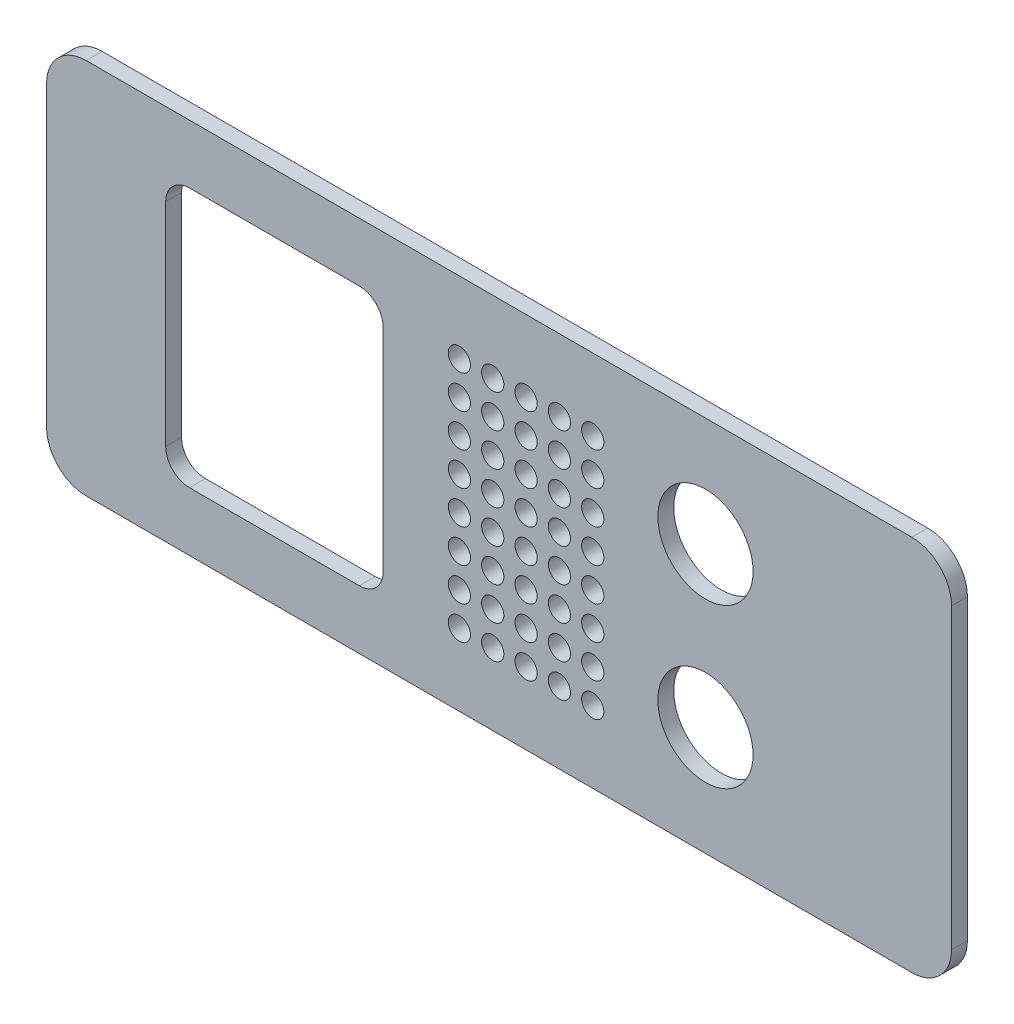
ISO-10303-21;
HEADER;
FILE_DESCRIPTION(('STEP AP214'),'2;1');
FILE_NAME('part.step','',(''),(''),'','','');
FILE_SCHEMA(('AUTOMOTIVE_DESIGN { 1 0 10303 214 1 1 1 1 }'));
ENDSEC;
DATA;
#1=APPLICATION_CONTEXT('core data for automotive mechanical design processes');
#2=APPLICATION_PROTOCOL_DEFINITION('international standard','automotive_design',2000,#1);
#3=PRODUCT_CONTEXT('',#1,'mechanical');
#4=PRODUCT('Part','Part','',(#3));
#5=PRODUCT_RELATED_PRODUCT_CATEGORY('part','',(#4));
#6=PRODUCT_DEFINITION_FORMATION('','',#4);
#7=PRODUCT_DEFINITION_CONTEXT('part definition',#1,'design');
#8=PRODUCT_DEFINITION('design','',#6,#7);
#9=PRODUCT_DEFINITION_SHAPE('','',#8);
#10=(LENGTH_UNIT() NAMED_UNIT(*) SI_UNIT(.MILLI.,.METRE.));
#11=(NAMED_UNIT(*) PLANE_ANGLE_UNIT() SI_UNIT($,.RADIAN.));
#12=(NAMED_UNIT(*) SI_UNIT($,.STERADIAN.) SOLID_ANGLE_UNIT());
#13=UNCERTAINTY_MEASURE_WITH_UNIT(LENGTH_MEASURE(1.E-05),#10,'distance_accuracy_value','');
#14=(GEOMETRIC_REPRESENTATION_CONTEXT(3) GLOBAL_UNCERTAINTY_ASSIGNED_CONTEXT((#13)) GLOBAL_UNIT_ASSIGNED_CONTEXT((#10,
#11,#12)) REPRESENTATION_CONTEXT('',''));
#15=CARTESIAN_POINT('',(0.,0.,0.));
#16=DIRECTION('',(0.,0.,1.));
#17=DIRECTION('',(1.,0.,0.));
#18=AXIS2_PLACEMENT_3D('',#15,#16,#17);
#19=CARTESIAN_POINT('',(-52.,-18.75,2.));
#20=DIRECTION('',(0.,0.,1.));
#21=DIRECTION('',(1.,0.,0.));
#22=AXIS2_PLACEMENT_3D('',#19,#20,#21);
#23=PLANE('',#22);
#24=CARTESIAN_POINT('',(26.,-10.,2.));
#25=DIRECTION('',(0.,0.,1.));
#26=DIRECTION('',(1.,0.,0.));
#27=AXIS2_PLACEMENT_3D('',#24,#25,#26);
#28=CIRCLE('',#27,5.99999999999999);
#29=CARTESIAN_POINT('',(32.,-10.,2.));
#30=VERTEX_POINT('',#29);
#31=EDGE_CURVE('E436',#30,#30,#28,.T.);
#32=ORIENTED_EDGE('',*,*,#31,.F.);
#33=EDGE_LOOP('',(#32));
#34=FACE_BOUND('',#33,.T.);
#35=CARTESIAN_POINT('',(7.59999999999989,14.7,2.));
#36=DIRECTION('',(0.,0.,1.));
#37=DIRECTION('',(1.,0.,0.));
#38=AXIS2_PLACEMENT_3D('',#35,#36,#37);
#39=CIRCLE('',#38,1.4);
#40=CARTESIAN_POINT('',(8.99999999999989,14.7,2.));
#41=VERTEX_POINT('',#40);
#42=EDGE_CURVE('E446',#41,#41,#39,.T.);
#43=ORIENTED_EDGE('',*,*,#42,.F.);
#44=EDGE_LOOP('',(#43));
#45=FACE_BOUND('',#44,.T.);
#46=CARTESIAN_POINT('',(-0.800000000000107,14.7,2.));
#47=DIRECTION('',(0.,0.,1.));
#48=DIRECTION('',(1.,0.,0.));
#49=AXIS2_PLACEMENT_3D('',#46,#47,#48);
#50=CIRCLE('',#49,1.4);
#51=CARTESIAN_POINT('',(0.599999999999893,14.7,2.));
#52=VERTEX_POINT('',#51);
#53=EDGE_CURVE('E456',#52,#52,#50,.T.);
#54=ORIENTED_EDGE('',*,*,#53,.F.);
#55=EDGE_LOOP('',(#54));
#56=FACE_BOUND('',#55,.T.);
#57=CARTESIAN_POINT('',(11.7999999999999,10.5,2.));
#58=DIRECTION('',(0.,0.,1.));
#59=DIRECTION('',(1.,0.,0.));
#60=AXIS2_PLACEMENT_3D('',#57,#58,#59);
#61=CIRCLE('',#60,1.4);
#62=CARTESIAN_POINT('',(13.1999999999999,10.5,2.));
#63=VERTEX_POINT('',#62);
#64=EDGE_CURVE('E466',#63,#63,#61,.T.);
#65=ORIENTED_EDGE('',*,*,#64,.F.);
#66=EDGE_LOOP('',(#65));
#67=FACE_BOUND('',#66,.T.);
#68=CARTESIAN_POINT('',(3.39999999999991,10.5,2.));
#69=DIRECTION('',(0.,0.,1.));
#70=DIRECTION('',(1.,0.,0.));
#71=AXIS2_PLACEMENT_3D('',#68,#69,#70);
#72=CIRCLE('',#71,1.4);
#73=CARTESIAN_POINT('',(4.79999999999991,10.5,2.));
#74=VERTEX_POINT('',#73);
#75=EDGE_CURVE('E476',#74,#74,#72,.T.);
#76=ORIENTED_EDGE('',*,*,#75,.F.);
#77=EDGE_LOOP('',(#76));
#78=FACE_BOUND('',#77,.T.);
#79=CARTESIAN_POINT('',(-5.00000000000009,10.5,2.));
#80=DIRECTION('',(0.,0.,1.));
#81=DIRECTION('',(1.,0.,0.));
#82=AXIS2_PLACEMENT_3D('',#79,#80,#81);
#83=CIRCLE('',#82,1.4);
#84=CARTESIAN_POINT('',(-3.60000000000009,10.5,2.));
#85=VERTEX_POINT('',#84);
#86=EDGE_CURVE('E486',#85,#85,#83,.T.);
#87=ORIENTED_EDGE('',*,*,#86,.F.);
#88=EDGE_LOOP('',(#87));
#89=FACE_BOUND('',#88,.T.);
#90=CARTESIAN_POINT('',(7.59999999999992,6.3,2.));
#91=DIRECTION('',(0.,0.,1.));
#92=DIRECTION('',(1.,0.,0.));
#93=AXIS2_PLACEMENT_3D('',#90,#91,#92);
#94=CIRCLE('',#93,1.4);
#95=CARTESIAN_POINT('',(8.99999999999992,6.3,2.));
#96=VERTEX_POINT('',#95);
#97=EDGE_CURVE('E496',#96,#96,#94,.T.);
#98=ORIENTED_EDGE('',*,*,#97,.F.);
#99=EDGE_LOOP('',(#98));
#100=FACE_BOUND('',#99,.T.);
#101=CARTESIAN_POINT('',(-0.800000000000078,6.3,2.));
#102=DIRECTION('',(0.,0.,1.));
#103=DIRECTION('',(1.,0.,0.));
#104=AXIS2_PLACEMENT_3D('',#101,#102,#103);
#105=CIRCLE('',#104,1.4);
#106=CARTESIAN_POINT('',(0.599999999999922,6.3,2.));
#107=VERTEX_POINT('',#106);
#108=EDGE_CURVE('E506',#107,#107,#105,.T.);
#109=ORIENTED_EDGE('',*,*,#108,.F.);
#110=EDGE_LOOP('',(#109));
#111=FACE_BOUND('',#110,.T.);
#112=CARTESIAN_POINT('',(11.7999999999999,2.1,2.));
#113=DIRECTION('',(0.,0.,1.));
#114=DIRECTION('',(1.,0.,0.));
#115=AXIS2_PLACEMENT_3D('',#112,#113,#114);
#116=CIRCLE('',#115,1.4);
#117=CARTESIAN_POINT('',(13.1999999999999,2.1,2.));
#118=VERTEX_POINT('',#117);
#119=EDGE_CURVE('E516',#118,#118,#116,.T.);
#120=ORIENTED_EDGE('',*,*,#119,.F.);
#121=EDGE_LOOP('',(#120));
#122=FACE_BOUND('',#121,.T.);
#123=CARTESIAN_POINT('',(3.39999999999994,2.1,2.));
#124=DIRECTION('',(0.,0.,1.));
#125=DIRECTION('',(1.,0.,0.));
#126=AXIS2_PLACEMENT_3D('',#123,#124,#125);
#127=CIRCLE('',#126,1.4);
#128=CARTESIAN_POINT('',(4.79999999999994,2.1,2.));
#129=VERTEX_POINT('',#128);
#130=EDGE_CURVE('E526',#129,#129,#127,.T.);
#131=ORIENTED_EDGE('',*,*,#130,.F.);
#132=EDGE_LOOP('',(#131));
#133=FACE_BOUND('',#132,.T.);
#134=CARTESIAN_POINT('',(-5.00000000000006,2.1,2.));
#135=DIRECTION('',(0.,0.,1.));
#136=DIRECTION('',(1.,0.,0.));
#137=AXIS2_PLACEMENT_3D('',#134,#135,#136);
#138=CIRCLE('',#137,1.4);
#139=CARTESIAN_POINT('',(-3.60000000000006,2.1,2.));
#140=VERTEX_POINT('',#139);
#141=EDGE_CURVE('E536',#140,#140,#138,.T.);
#142=ORIENTED_EDGE('',*,*,#141,.F.);
#143=EDGE_LOOP('',(#142));
#144=FACE_BOUND('',#143,.T.);
#145=CARTESIAN_POINT('',(7.59999999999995,-2.1,2.));
#146=DIRECTION('',(0.,0.,1.));
#147=DIRECTION('',(1.,0.,0.));
#148=AXIS2_PLACEMENT_3D('',#145,#146,#147);
#149=CIRCLE('',#148,1.4);
#150=CARTESIAN_POINT('',(8.99999999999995,-2.1,2.));
#151=VERTEX_POINT('',#150);
#152=EDGE_CURVE('E546',#151,#151,#149,.T.);
#153=ORIENTED_EDGE('',*,*,#152,.F.);
#154=EDGE_LOOP('',(#153));
#155=FACE_BOUND('',#154,.T.);
#156=CARTESIAN_POINT('',(-0.800000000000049,-2.1,2.));
#157=DIRECTION('',(0.,0.,1.));
#158=DIRECTION('',(1.,0.,0.));
#159=AXIS2_PLACEMENT_3D('',#156,#157,#158);
#160=CIRCLE('',#159,1.4);
#161=CARTESIAN_POINT('',(0.599999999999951,-2.1,2.));
#162=VERTEX_POINT('',#161);
#163=EDGE_CURVE('E556',#162,#162,#160,.T.);
#164=ORIENTED_EDGE('',*,*,#163,.F.);
#165=EDGE_LOOP('',(#164));
#166=FACE_BOUND('',#165,.T.);
#167=CARTESIAN_POINT('',(11.8,-6.3,2.));
#168=DIRECTION('',(0.,0.,1.));
#169=DIRECTION('',(1.,0.,0.));
#170=AXIS2_PLACEMENT_3D('',#167,#168,#169);
#171=CIRCLE('',#170,1.4);
#172=CARTESIAN_POINT('',(13.2,-6.3,2.));
#173=VERTEX_POINT('',#172);
#174=EDGE_CURVE('E566',#173,#173,#171,.T.);
#175=ORIENTED_EDGE('',*,*,#174,.F.);
#176=EDGE_LOOP('',(#175));
#177=FACE_BOUND('',#176,.T.);
#178=CARTESIAN_POINT('',(3.39999999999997,-6.3,2.));
#179=DIRECTION('',(0.,0.,1.));
#180=DIRECTION('',(1.,0.,0.));
#181=AXIS2_PLACEMENT_3D('',#178,#179,#180);
#182=CIRCLE('',#181,1.4);
#183=CARTESIAN_POINT('',(4.79999999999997,-6.3,2.));
#184=VERTEX_POINT('',#183);
#185=EDGE_CURVE('E576',#184,#184,#182,.T.);
#186=ORIENTED_EDGE('',*,*,#185,.F.);
#187=EDGE_LOOP('',(#186));
#188=FACE_BOUND('',#187,.T.);
#189=CARTESIAN_POINT('',(-5.00000000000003,-6.3,2.));
#190=DIRECTION('',(0.,0.,1.));
#191=DIRECTION('',(1.,0.,0.));
#192=AXIS2_PLACEMENT_3D('',#189,#190,#191);
#193=CIRCLE('',#192,1.4);
#194=CARTESIAN_POINT('',(-3.60000000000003,-6.3,2.));
#195=VERTEX_POINT('',#194);
#196=EDGE_CURVE('E586',#195,#195,#193,.T.);
#197=ORIENTED_EDGE('',*,*,#196,.F.);
#198=EDGE_LOOP('',(#197));
#199=FACE_BOUND('',#198,.T.);
#200=CARTESIAN_POINT('',(7.59999999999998,-10.5,2.));
#201=DIRECTION('',(0.,0.,1.));
#202=DIRECTION('',(1.,0.,0.));
#203=AXIS2_PLACEMENT_3D('',#200,#201,#202);
#204=CIRCLE('',#203,1.4);
#205=CARTESIAN_POINT('',(8.99999999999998,-10.5,2.));
#206=VERTEX_POINT('',#205);
#207=EDGE_CURVE('E596',#206,#206,#204,.T.);
#208=ORIENTED_EDGE('',*,*,#207,.F.);
#209=EDGE_LOOP('',(#208));
#210=FACE_BOUND('',#209,.T.);
#211=CARTESIAN_POINT('',(-0.800000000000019,-10.5,2.));
#212=DIRECTION('',(0.,0.,1.));
#213=DIRECTION('',(1.,0.,0.));
#214=AXIS2_PLACEMENT_3D('',#211,#212,#213);
#215=CIRCLE('',#214,1.4);
#216=CARTESIAN_POINT('',(0.599999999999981,-10.5,2.));
#217=VERTEX_POINT('',#216);
#218=EDGE_CURVE('E606',#217,#217,#215,.T.);
#219=ORIENTED_EDGE('',*,*,#218,.F.);
#220=EDGE_LOOP('',(#219));
#221=FACE_BOUND('',#220,.T.);
#222=CARTESIAN_POINT('',(11.8,-14.7,2.));
#223=DIRECTION('',(0.,0.,1.));
#224=DIRECTION('',(1.,0.,0.));
#225=AXIS2_PLACEMENT_3D('',#222,#223,#224);
#226=CIRCLE('',#225,1.4);
#227=CARTESIAN_POINT('',(13.2,-14.7,2.));
#228=VERTEX_POINT('',#227);
#229=EDGE_CURVE('E616',#228,#228,#226,.T.);
#230=ORIENTED_EDGE('',*,*,#229,.F.);
#231=EDGE_LOOP('',(#230));
#232=FACE_BOUND('',#231,.T.);
#233=CARTESIAN_POINT('',(3.4,-14.7,2.));
#234=DIRECTION('',(0.,0.,1.));
#235=DIRECTION('',(1.,0.,0.));
#236=AXIS2_PLACEMENT_3D('',#233,#234,#235);
#237=CIRCLE('',#236,1.4);
#238=CARTESIAN_POINT('',(4.8,-14.7,2.));
#239=VERTEX_POINT('',#238);
#240=EDGE_CURVE('E626',#239,#239,#237,.T.);
#241=ORIENTED_EDGE('',*,*,#240,.F.);
#242=EDGE_LOOP('',(#241));
#243=FACE_BOUND('',#242,.T.);
#244=DIRECTION('',(0.,1.,0.));
#245=VECTOR('',#244,1.);
#246=CARTESIAN_POINT('',(-14.6,13.35,2.));
#247=LINE('',#246,#245);
#248=CARTESIAN_POINT('',(-14.6,-13.35,2.));
#249=VERTEX_POINT('',#248);
#250=CARTESIAN_POINT('',(-14.6,13.35,2.));
#251=VERTEX_POINT('',#250);
#252=EDGE_CURVE('E154',#249,#251,#247,.T.);
#253=ORIENTED_EDGE('',*,*,#252,.F.);
#254=CARTESIAN_POINT('',(-17.6,-13.35,2.));
#255=DIRECTION('',(0.,0.,1.));
#256=DIRECTION('',(1.,0.,0.));
#257=AXIS2_PLACEMENT_3D('',#254,#255,#256);
#258=CIRCLE('',#257,3.);
#259=CARTESIAN_POINT('',(-17.6,-16.35,2.));
#260=VERTEX_POINT('',#259);
#261=EDGE_CURVE('E146',#260,#249,#258,.T.);
#262=ORIENTED_EDGE('',*,*,#261,.F.);
#263=DIRECTION('',(1.,0.,0.));
#264=VECTOR('',#263,1.);
#265=CARTESIAN_POINT('',(-39.,-16.35,2.));
#266=LINE('',#265,#264);
#267=CARTESIAN_POINT('',(-39.,-16.35,2.));
#268=VERTEX_POINT('',#267);
#269=EDGE_CURVE('E181',#268,#260,#266,.T.);
#270=ORIENTED_EDGE('',*,*,#269,.F.);
#271=CARTESIAN_POINT('',(-39.,-13.35,2.));
#272=DIRECTION('',(0.,0.,1.));
#273=DIRECTION('',(1.,0.,0.));
#274=AXIS2_PLACEMENT_3D('',#271,#272,#273);
#275=CIRCLE('',#274,3.);
#276=CARTESIAN_POINT('',(-42.,-13.35,2.));
#277=VERTEX_POINT('',#276);
#278=EDGE_CURVE('E179',#277,#268,#275,.T.);
#279=ORIENTED_EDGE('',*,*,#278,.F.);
#280=DIRECTION('',(0.,-1.,0.));
#281=VECTOR('',#280,1.);
#282=CARTESIAN_POINT('',(-42.,13.35,2.));
#283=LINE('',#282,#281);
#284=CARTESIAN_POINT('',(-42.,13.35,2.));
#285=VERTEX_POINT('',#284);
#286=EDGE_CURVE('E177',#285,#277,#283,.T.);
#287=ORIENTED_EDGE('',*,*,#286,.F.);
#288=CARTESIAN_POINT('',(-39.,13.35,2.));
#289=DIRECTION('',(0.,0.,1.));
#290=DIRECTION('',(1.,0.,0.));
#291=AXIS2_PLACEMENT_3D('',#288,#289,#290);
#292=CIRCLE('',#291,3.);
#293=CARTESIAN_POINT('',(-39.,16.35,2.));
#294=VERTEX_POINT('',#293);
#295=EDGE_CURVE('E175',#294,#285,#292,.T.);
#296=ORIENTED_EDGE('',*,*,#295,.F.);
#297=DIRECTION('',(-1.,0.,0.));
#298=VECTOR('',#297,1.);
#299=CARTESIAN_POINT('',(-39.,16.35,2.));
#300=LINE('',#299,#298);
#301=CARTESIAN_POINT('',(-17.6,16.35,2.));
#302=VERTEX_POINT('',#301);
#303=EDGE_CURVE('E170',#302,#294,#300,.T.);
#304=ORIENTED_EDGE('',*,*,#303,.F.);
#305=CARTESIAN_POINT('',(-17.6,13.35,2.));
#306=DIRECTION('',(0.,0.,1.));
#307=DIRECTION('',(-1.,0.,0.));
#308=AXIS2_PLACEMENT_3D('',#305,#306,#307);
#309=CIRCLE('',#308,3.);
#310=EDGE_CURVE('E168',#251,#302,#309,.T.);
#311=ORIENTED_EDGE('',*,*,#310,.F.);
#312=EDGE_LOOP('',(#253,#262,#270,#279,#287,#296,#304,#311));
#313=FACE_BOUND('',#312,.T.);
#314=CARTESIAN_POINT('',(-52.,-18.75,2.));
#315=DIRECTION('',(0.,0.,1.));
#316=DIRECTION('',(1.,0.,0.));
#317=AXIS2_PLACEMENT_3D('',#314,#315,#316);
#318=CIRCLE('',#317,5.);
#319=CARTESIAN_POINT('',(-57.,-18.75,2.));
#320=VERTEX_POINT('',#319);
#321=CARTESIAN_POINT('',(-52.,-23.75,2.));
#322=VERTEX_POINT('',#321);
#323=EDGE_CURVE('E220',#320,#322,#318,.T.);
#324=ORIENTED_EDGE('',*,*,#323,.T.);
#325=DIRECTION('',(1.,0.,0.));
#326=VECTOR('',#325,1.);
#327=CARTESIAN_POINT('',(-52.,-23.75,2.));
#328=LINE('',#327,#326);
#329=CARTESIAN_POINT('',(52.,-23.75,2.));
#330=VERTEX_POINT('',#329);
#331=EDGE_CURVE('E223',#322,#330,#328,.T.);
#332=ORIENTED_EDGE('',*,*,#331,.T.);
#333=CARTESIAN_POINT('',(52.,-18.75,2.));
#334=DIRECTION('',(0.,0.,1.));
#335=DIRECTION('',(1.,0.,0.));
#336=AXIS2_PLACEMENT_3D('',#333,#334,#335);
#337=CIRCLE('',#336,5.);
#338=CARTESIAN_POINT('',(57.,-18.75,2.));
#339=VERTEX_POINT('',#338);
#340=EDGE_CURVE('E226',#330,#339,#337,.T.);
#341=ORIENTED_EDGE('',*,*,#340,.T.);
#342=DIRECTION('',(0.,1.,0.));
#343=VECTOR('',#342,1.);
#344=CARTESIAN_POINT('',(57.,18.75,2.));
#345=LINE('',#344,#343);
#346=CARTESIAN_POINT('',(57.,18.75,2.));
#347=VERTEX_POINT('',#346);
#348=EDGE_CURVE('E228',#339,#347,#345,.T.);
#349=ORIENTED_EDGE('',*,*,#348,.T.);
#350=CARTESIAN_POINT('',(52.,18.75,2.));
#351=DIRECTION('',(0.,0.,1.));
#352=DIRECTION('',(-1.,0.,0.));
#353=AXIS2_PLACEMENT_3D('',#350,#351,#352);
#354=CIRCLE('',#353,5.);
#355=CARTESIAN_POINT('',(52.,23.75,2.));
#356=VERTEX_POINT('',#355);
#357=EDGE_CURVE('E230',#347,#356,#354,.T.);
#358=ORIENTED_EDGE('',*,*,#357,.T.);
#359=DIRECTION('',(-1.,0.,0.));
#360=VECTOR('',#359,1.);
#361=CARTESIAN_POINT('',(-52.,23.75,2.));
#362=LINE('',#361,#360);
#363=CARTESIAN_POINT('',(-52.,23.75,2.));
#364=VERTEX_POINT('',#363);
#365=EDGE_CURVE('E232',#356,#364,#362,.T.);
#366=ORIENTED_EDGE('',*,*,#365,.T.);
#367=CARTESIAN_POINT('',(-52.,18.75,2.));
#368=DIRECTION('',(0.,0.,1.));
#369=DIRECTION('',(1.,0.,0.));
#370=AXIS2_PLACEMENT_3D('',#367,#368,#369);
#371=CIRCLE('',#370,5.);
#372=CARTESIAN_POINT('',(-57.,18.75,2.));
#373=VERTEX_POINT('',#372);
#374=EDGE_CURVE('E234',#364,#373,#371,.T.);
#375=ORIENTED_EDGE('',*,*,#374,.T.);
#376=DIRECTION('',(0.,-1.,0.));
#377=VECTOR('',#376,1.);
#378=CARTESIAN_POINT('',(-57.,18.75,2.));
#379=LINE('',#378,#377);
#380=EDGE_CURVE('E236',#373,#320,#379,.T.);
#381=ORIENTED_EDGE('',*,*,#380,.T.);
#382=EDGE_LOOP('',(#324,#332,#341,#349,#358,#366,#375,#381));
#383=FACE_BOUND('',#382,.T.);
#384=CARTESIAN_POINT('',(-5.,-14.7,2.));
#385=DIRECTION('',(0.,0.,1.));
#386=DIRECTION('',(1.,0.,0.));
#387=AXIS2_PLACEMENT_3D('',#384,#385,#386);
#388=CIRCLE('',#387,1.4);
#389=CARTESIAN_POINT('',(-3.6,-14.7,2.));
#390=VERTEX_POINT('',#389);
#391=EDGE_CURVE('E214',#390,#390,#388,.T.);
#392=ORIENTED_EDGE('',*,*,#391,.F.);
#393=EDGE_LOOP('',(#392));
#394=FACE_BOUND('',#393,.T.);
#395=CARTESIAN_POINT('',(-0.800000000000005,-14.7,2.));
#396=DIRECTION('',(0.,0.,1.));
#397=DIRECTION('',(1.,0.,0.));
#398=AXIS2_PLACEMENT_3D('',#395,#396,#397);
#399=CIRCLE('',#398,1.4);
#400=CARTESIAN_POINT('',(0.599999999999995,-14.7,2.));
#401=VERTEX_POINT('',#400);
#402=EDGE_CURVE('E184',#401,#401,#399,.T.);
#403=ORIENTED_EDGE('',*,*,#402,.F.);
#404=EDGE_LOOP('',(#403));
#405=FACE_BOUND('',#404,.T.);
#406=CARTESIAN_POINT('',(7.6,-14.7,2.));
#407=DIRECTION('',(0.,0.,1.));
#408=DIRECTION('',(1.,0.,0.));
#409=AXIS2_PLACEMENT_3D('',#406,#407,#408);
#410=CIRCLE('',#409,1.4);
#411=CARTESIAN_POINT('',(8.99999999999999,-14.7,2.));
#412=VERTEX_POINT('',#411);
#413=EDGE_CURVE('E621',#412,#412,#410,.T.);
#414=ORIENTED_EDGE('',*,*,#413,.F.);
#415=EDGE_LOOP('',(#414));
#416=FACE_BOUND('',#415,.T.);
#417=CARTESIAN_POINT('',(-5.00000000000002,-10.5,2.));
#418=DIRECTION('',(0.,0.,1.));
#419=DIRECTION('',(1.,0.,0.));
#420=AXIS2_PLACEMENT_3D('',#417,#418,#419);
#421=CIRCLE('',#420,1.4);
#422=CARTESIAN_POINT('',(-3.60000000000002,-10.5,2.));
#423=VERTEX_POINT('',#422);
#424=EDGE_CURVE('E611',#423,#423,#421,.T.);
#425=ORIENTED_EDGE('',*,*,#424,.F.);
#426=EDGE_LOOP('',(#425));
#427=FACE_BOUND('',#426,.T.);
#428=CARTESIAN_POINT('',(3.39999999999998,-10.5,2.));
#429=DIRECTION('',(0.,0.,1.));
#430=DIRECTION('',(1.,0.,0.));
#431=AXIS2_PLACEMENT_3D('',#428,#429,#430);
#432=CIRCLE('',#431,1.4);
#433=CARTESIAN_POINT('',(4.79999999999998,-10.5,2.));
#434=VERTEX_POINT('',#433);
#435=EDGE_CURVE('E601',#434,#434,#432,.T.);
#436=ORIENTED_EDGE('',*,*,#435,.F.);
#437=EDGE_LOOP('',(#436));
#438=FACE_BOUND('',#437,.T.);
#439=CARTESIAN_POINT('',(11.8,-10.5,2.));
#440=DIRECTION('',(0.,0.,1.));
#441=DIRECTION('',(1.,0.,0.));
#442=AXIS2_PLACEMENT_3D('',#439,#440,#441);
#443=CIRCLE('',#442,1.4);
#444=CARTESIAN_POINT('',(13.2,-10.5,2.));
#445=VERTEX_POINT('',#444);
#446=EDGE_CURVE('E591',#445,#445,#443,.T.);
#447=ORIENTED_EDGE('',*,*,#446,.F.);
#448=EDGE_LOOP('',(#447));
#449=FACE_BOUND('',#448,.T.);
#450=CARTESIAN_POINT('',(-0.800000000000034,-6.3,2.));
#451=DIRECTION('',(0.,0.,1.));
#452=DIRECTION('',(1.,0.,0.));
#453=AXIS2_PLACEMENT_3D('',#450,#451,#452);
#454=CIRCLE('',#453,1.4);
#455=CARTESIAN_POINT('',(0.599999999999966,-6.3,2.));
#456=VERTEX_POINT('',#455);
#457=EDGE_CURVE('E581',#456,#456,#454,.T.);
#458=ORIENTED_EDGE('',*,*,#457,.F.);
#459=EDGE_LOOP('',(#458));
#460=FACE_BOUND('',#459,.T.);
#461=CARTESIAN_POINT('',(7.59999999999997,-6.3,2.));
#462=DIRECTION('',(0.,0.,1.));
#463=DIRECTION('',(1.,0.,0.));
#464=AXIS2_PLACEMENT_3D('',#461,#462,#463);
#465=CIRCLE('',#464,1.4);
#466=CARTESIAN_POINT('',(8.99999999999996,-6.3,2.));
#467=VERTEX_POINT('',#466);
#468=EDGE_CURVE('E571',#467,#467,#465,.T.);
#469=ORIENTED_EDGE('',*,*,#468,.F.);
#470=EDGE_LOOP('',(#469));
#471=FACE_BOUND('',#470,.T.);
#472=CARTESIAN_POINT('',(-5.00000000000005,-2.1,2.));
#473=DIRECTION('',(0.,0.,1.));
#474=DIRECTION('',(1.,0.,0.));
#475=AXIS2_PLACEMENT_3D('',#472,#473,#474);
#476=CIRCLE('',#475,1.4);
#477=CARTESIAN_POINT('',(-3.60000000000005,-2.1,2.));
#478=VERTEX_POINT('',#477);
#479=EDGE_CURVE('E561',#478,#478,#476,.T.);
#480=ORIENTED_EDGE('',*,*,#479,.F.);
#481=EDGE_LOOP('',(#480));
#482=FACE_BOUND('',#481,.T.);
#483=CARTESIAN_POINT('',(3.39999999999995,-2.1,2.));
#484=DIRECTION('',(0.,0.,1.));
#485=DIRECTION('',(1.,0.,0.));
#486=AXIS2_PLACEMENT_3D('',#483,#484,#485);
#487=CIRCLE('',#486,1.4);
#488=CARTESIAN_POINT('',(4.79999999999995,-2.1,2.));
#489=VERTEX_POINT('',#488);
#490=EDGE_CURVE('E551',#489,#489,#487,.T.);
#491=ORIENTED_EDGE('',*,*,#490,.F.);
#492=EDGE_LOOP('',(#491));
#493=FACE_BOUND('',#492,.T.);
#494=CARTESIAN_POINT('',(11.7999999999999,-2.1,2.));
#495=DIRECTION('',(0.,0.,1.));
#496=DIRECTION('',(1.,0.,0.));
#497=AXIS2_PLACEMENT_3D('',#494,#495,#496);
#498=CIRCLE('',#497,1.4);
#499=CARTESIAN_POINT('',(13.1999999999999,-2.1,2.));
#500=VERTEX_POINT('',#499);
#501=EDGE_CURVE('E541',#500,#500,#498,.T.);
#502=ORIENTED_EDGE('',*,*,#501,.F.);
#503=EDGE_LOOP('',(#502));
#504=FACE_BOUND('',#503,.T.);
#505=CARTESIAN_POINT('',(-0.800000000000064,2.1,2.));
#506=DIRECTION('',(0.,0.,1.));
#507=DIRECTION('',(1.,0.,0.));
#508=AXIS2_PLACEMENT_3D('',#505,#506,#507);
#509=CIRCLE('',#508,1.4);
#510=CARTESIAN_POINT('',(0.599999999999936,2.1,2.));
#511=VERTEX_POINT('',#510);
#512=EDGE_CURVE('E531',#511,#511,#509,.T.);
#513=ORIENTED_EDGE('',*,*,#512,.F.);
#514=EDGE_LOOP('',(#513));
#515=FACE_BOUND('',#514,.T.);
#516=CARTESIAN_POINT('',(7.59999999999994,2.1,2.));
#517=DIRECTION('',(0.,0.,1.));
#518=DIRECTION('',(1.,0.,0.));
#519=AXIS2_PLACEMENT_3D('',#516,#517,#518);
#520=CIRCLE('',#519,1.4);
#521=CARTESIAN_POINT('',(8.99999999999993,2.1,2.));
#522=VERTEX_POINT('',#521);
#523=EDGE_CURVE('E521',#522,#522,#520,.T.);
#524=ORIENTED_EDGE('',*,*,#523,.F.);
#525=EDGE_LOOP('',(#524));
#526=FACE_BOUND('',#525,.T.);
#527=CARTESIAN_POINT('',(-5.00000000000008,6.3,2.));
#528=DIRECTION('',(0.,0.,1.));
#529=DIRECTION('',(1.,0.,0.));
#530=AXIS2_PLACEMENT_3D('',#527,#528,#529);
#531=CIRCLE('',#530,1.4);
#532=CARTESIAN_POINT('',(-3.60000000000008,6.3,2.));
#533=VERTEX_POINT('',#532);
#534=EDGE_CURVE('E511',#533,#533,#531,.T.);
#535=ORIENTED_EDGE('',*,*,#534,.F.);
#536=EDGE_LOOP('',(#535));
#537=FACE_BOUND('',#536,.T.);
#538=CARTESIAN_POINT('',(3.39999999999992,6.3,2.));
#539=DIRECTION('',(0.,0.,1.));
#540=DIRECTION('',(1.,0.,0.));
#541=AXIS2_PLACEMENT_3D('',#538,#539,#540);
#542=CIRCLE('',#541,1.4);
#543=CARTESIAN_POINT('',(4.79999999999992,6.3,2.));
#544=VERTEX_POINT('',#543);
#545=EDGE_CURVE('E501',#544,#544,#542,.T.);
#546=ORIENTED_EDGE('',*,*,#545,.F.);
#547=EDGE_LOOP('',(#546));
#548=FACE_BOUND('',#547,.T.);
#549=CARTESIAN_POINT('',(11.7999999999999,6.3,2.));
#550=DIRECTION('',(0.,0.,1.));
#551=DIRECTION('',(1.,0.,0.));
#552=AXIS2_PLACEMENT_3D('',#549,#550,#551);
#553=CIRCLE('',#552,1.4);
#554=CARTESIAN_POINT('',(13.1999999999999,6.3,2.));
#555=VERTEX_POINT('',#554);
#556=EDGE_CURVE('E491',#555,#555,#553,.T.);
#557=ORIENTED_EDGE('',*,*,#556,.F.);
#558=EDGE_LOOP('',(#557));
#559=FACE_BOUND('',#558,.T.);
#560=CARTESIAN_POINT('',(-0.800000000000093,10.5,2.));
#561=DIRECTION('',(0.,0.,1.));
#562=DIRECTION('',(1.,0.,0.));
#563=AXIS2_PLACEMENT_3D('',#560,#561,#562);
#564=CIRCLE('',#563,1.4);
#565=CARTESIAN_POINT('',(0.599999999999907,10.5,2.));
#566=VERTEX_POINT('',#565);
#567=EDGE_CURVE('E481',#566,#566,#564,.T.);
#568=ORIENTED_EDGE('',*,*,#567,.F.);
#569=EDGE_LOOP('',(#568));
#570=FACE_BOUND('',#569,.T.);
#571=CARTESIAN_POINT('',(7.59999999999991,10.5,2.));
#572=DIRECTION('',(0.,0.,1.));
#573=DIRECTION('',(1.,0.,0.));
#574=AXIS2_PLACEMENT_3D('',#571,#572,#573);
#575=CIRCLE('',#574,1.4);
#576=CARTESIAN_POINT('',(8.9999999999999,10.5,2.));
#577=VERTEX_POINT('',#576);
#578=EDGE_CURVE('E471',#577,#577,#575,.T.);
#579=ORIENTED_EDGE('',*,*,#578,.F.);
#580=EDGE_LOOP('',(#579));
#581=FACE_BOUND('',#580,.T.);
#582=CARTESIAN_POINT('',(-5.00000000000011,14.7,2.));
#583=DIRECTION('',(0.,0.,1.));
#584=DIRECTION('',(1.,0.,0.));
#585=AXIS2_PLACEMENT_3D('',#582,#583,#584);
#586=CIRCLE('',#585,1.4);
#587=CARTESIAN_POINT('',(-3.60000000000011,14.7,2.));
#588=VERTEX_POINT('',#587);
#589=EDGE_CURVE('E461',#588,#588,#586,.T.);
#590=ORIENTED_EDGE('',*,*,#589,.F.);
#591=EDGE_LOOP('',(#590));
#592=FACE_BOUND('',#591,.T.);
#593=CARTESIAN_POINT('',(3.39999999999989,14.7,2.));
#594=DIRECTION('',(0.,0.,1.));
#595=DIRECTION('',(1.,0.,0.));
#596=AXIS2_PLACEMENT_3D('',#593,#594,#595);
#597=CIRCLE('',#596,1.4);
#598=CARTESIAN_POINT('',(4.79999999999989,14.7,2.));
#599=VERTEX_POINT('',#598);
#600=EDGE_CURVE('E451',#599,#599,#597,.T.);
#601=ORIENTED_EDGE('',*,*,#600,.F.);
#602=EDGE_LOOP('',(#601));
#603=FACE_BOUND('',#602,.T.);
#604=CARTESIAN_POINT('',(11.7999999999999,14.7,2.));
#605=DIRECTION('',(0.,0.,1.));
#606=DIRECTION('',(1.,0.,0.));
#607=AXIS2_PLACEMENT_3D('',#604,#605,#606);
#608=CIRCLE('',#607,1.4);
#609=CARTESIAN_POINT('',(13.1999999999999,14.7,2.));
#610=VERTEX_POINT('',#609);
#611=EDGE_CURVE('E441',#610,#610,#608,.T.);
#612=ORIENTED_EDGE('',*,*,#611,.F.);
#613=EDGE_LOOP('',(#612));
#614=FACE_BOUND('',#613,.T.);
#615=CARTESIAN_POINT('',(26.,10.,2.));
#616=DIRECTION('',(0.,0.,1.));
#617=DIRECTION('',(1.,0.,0.));
#618=AXIS2_PLACEMENT_3D('',#615,#616,#617);
#619=CIRCLE('',#618,6.00000000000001);
#620=CARTESIAN_POINT('',(32.,10.,2.));
#621=VERTEX_POINT('',#620);
#622=EDGE_CURVE('E430',#621,#621,#619,.T.);
#623=ORIENTED_EDGE('',*,*,#622,.F.);
#624=EDGE_LOOP('',(#623));
#625=FACE_BOUND('',#624,.T.);
#626=ADVANCED_FACE('F33',(#34,#45,#56,#67,#78,#89,#100,#111,#122,#133,#144,#155,#166,#177,#188,
#199,#210,#221,#232,#243,#313,#383,#394,#405,#416,#427,#438,#449,#460,#471,#482,#493,#504,#515,
#526,#537,#548,#559,#570,#581,#592,#603,#614,#625),#23,.T.);
#627=CARTESIAN_POINT('',(-52.,-18.75,0.));
#628=DIRECTION('',(0.,0.,1.));
#629=DIRECTION('',(1.,0.,0.));
#630=AXIS2_PLACEMENT_3D('',#627,#628,#629);
#631=PLANE('',#630);
#632=CARTESIAN_POINT('',(26.,-10.,0.));
#633=DIRECTION('',(0.,0.,1.));
#634=DIRECTION('',(1.,0.,0.));
#635=AXIS2_PLACEMENT_3D('',#632,#633,#634);
#636=CIRCLE('',#635,5.99999999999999);
#637=CARTESIAN_POINT('',(32.,-10.,0.));
#638=VERTEX_POINT('',#637);
#639=EDGE_CURVE('E433',#638,#638,#636,.T.);
#640=ORIENTED_EDGE('',*,*,#639,.T.);
#641=EDGE_LOOP('',(#640));
#642=FACE_BOUND('',#641,.T.);
#643=CARTESIAN_POINT('',(7.59999999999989,14.7,0.));
#644=DIRECTION('',(0.,0.,1.));
#645=DIRECTION('',(1.,0.,0.));
#646=AXIS2_PLACEMENT_3D('',#643,#644,#645);
#647=CIRCLE('',#646,1.4);
#648=CARTESIAN_POINT('',(8.99999999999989,14.7,0.));
#649=VERTEX_POINT('',#648);
#650=EDGE_CURVE('E444',#649,#649,#647,.T.);
#651=ORIENTED_EDGE('',*,*,#650,.T.);
#652=EDGE_LOOP('',(#651));
#653=FACE_BOUND('',#652,.T.);
#654=CARTESIAN_POINT('',(-0.800000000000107,14.7,0.));
#655=DIRECTION('',(0.,0.,1.));
#656=DIRECTION('',(1.,0.,0.));
#657=AXIS2_PLACEMENT_3D('',#654,#655,#656);
#658=CIRCLE('',#657,1.4);
#659=CARTESIAN_POINT('',(0.599999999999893,14.7,0.));
#660=VERTEX_POINT('',#659);
#661=EDGE_CURVE('E454',#660,#660,#658,.T.);
#662=ORIENTED_EDGE('',*,*,#661,.T.);
#663=EDGE_LOOP('',(#662));
#664=FACE_BOUND('',#663,.T.);
#665=CARTESIAN_POINT('',(11.7999999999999,10.5,0.));
#666=DIRECTION('',(0.,0.,1.));
#667=DIRECTION('',(1.,0.,0.));
#668=AXIS2_PLACEMENT_3D('',#665,#666,#667);
#669=CIRCLE('',#668,1.4);
#670=CARTESIAN_POINT('',(13.1999999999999,10.5,0.));
#671=VERTEX_POINT('',#670);
#672=EDGE_CURVE('E464',#671,#671,#669,.T.);
#673=ORIENTED_EDGE('',*,*,#672,.T.);
#674=EDGE_LOOP('',(#673));
#675=FACE_BOUND('',#674,.T.);
#676=CARTESIAN_POINT('',(3.39999999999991,10.5,0.));
#677=DIRECTION('',(0.,0.,1.));
#678=DIRECTION('',(1.,0.,0.));
#679=AXIS2_PLACEMENT_3D('',#676,#677,#678);
#680=CIRCLE('',#679,1.4);
#681=CARTESIAN_POINT('',(4.79999999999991,10.5,0.));
#682=VERTEX_POINT('',#681);
#683=EDGE_CURVE('E474',#682,#682,#680,.T.);
#684=ORIENTED_EDGE('',*,*,#683,.T.);
#685=EDGE_LOOP('',(#684));
#686=FACE_BOUND('',#685,.T.);
#687=CARTESIAN_POINT('',(-5.00000000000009,10.5,0.));
#688=DIRECTION('',(0.,0.,1.));
#689=DIRECTION('',(1.,0.,0.));
#690=AXIS2_PLACEMENT_3D('',#687,#688,#689);
#691=CIRCLE('',#690,1.4);
#692=CARTESIAN_POINT('',(-3.60000000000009,10.5,0.));
#693=VERTEX_POINT('',#692);
#694=EDGE_CURVE('E484',#693,#693,#691,.T.);
#695=ORIENTED_EDGE('',*,*,#694,.T.);
#696=EDGE_LOOP('',(#695));
#697=FACE_BOUND('',#696,.T.);
#698=CARTESIAN_POINT('',(7.59999999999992,6.3,0.));
#699=DIRECTION('',(0.,0.,1.));
#700=DIRECTION('',(1.,0.,0.));
#701=AXIS2_PLACEMENT_3D('',#698,#699,#700);
#702=CIRCLE('',#701,1.4);
#703=CARTESIAN_POINT('',(8.99999999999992,6.3,0.));
#704=VERTEX_POINT('',#703);
#705=EDGE_CURVE('E494',#704,#704,#702,.T.);
#706=ORIENTED_EDGE('',*,*,#705,.T.);
#707=EDGE_LOOP('',(#706));
#708=FACE_BOUND('',#707,.T.);
#709=CARTESIAN_POINT('',(-0.800000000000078,6.3,0.));
#710=DIRECTION('',(0.,0.,1.));
#711=DIRECTION('',(1.,0.,0.));
#712=AXIS2_PLACEMENT_3D('',#709,#710,#711);
#713=CIRCLE('',#712,1.4);
#714=CARTESIAN_POINT('',(0.599999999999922,6.3,0.));
#715=VERTEX_POINT('',#714);
#716=EDGE_CURVE('E504',#715,#715,#713,.T.);
#717=ORIENTED_EDGE('',*,*,#716,.T.);
#718=EDGE_LOOP('',(#717));
#719=FACE_BOUND('',#718,.T.);
#720=CARTESIAN_POINT('',(11.7999999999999,2.1,0.));
#721=DIRECTION('',(0.,0.,1.));
#722=DIRECTION('',(1.,0.,0.));
#723=AXIS2_PLACEMENT_3D('',#720,#721,#722);
#724=CIRCLE('',#723,1.4);
#725=CARTESIAN_POINT('',(13.1999999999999,2.1,0.));
#726=VERTEX_POINT('',#725);
#727=EDGE_CURVE('E514',#726,#726,#724,.T.);
#728=ORIENTED_EDGE('',*,*,#727,.T.);
#729=EDGE_LOOP('',(#728));
#730=FACE_BOUND('',#729,.T.);
#731=CARTESIAN_POINT('',(3.39999999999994,2.1,0.));
#732=DIRECTION('',(0.,0.,1.));
#733=DIRECTION('',(1.,0.,0.));
#734=AXIS2_PLACEMENT_3D('',#731,#732,#733);
#735=CIRCLE('',#734,1.4);
#736=CARTESIAN_POINT('',(4.79999999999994,2.1,0.));
#737=VERTEX_POINT('',#736);
#738=EDGE_CURVE('E524',#737,#737,#735,.T.);
#739=ORIENTED_EDGE('',*,*,#738,.T.);
#740=EDGE_LOOP('',(#739));
#741=FACE_BOUND('',#740,.T.);
#742=CARTESIAN_POINT('',(-5.00000000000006,2.1,0.));
#743=DIRECTION('',(0.,0.,1.));
#744=DIRECTION('',(1.,0.,0.));
#745=AXIS2_PLACEMENT_3D('',#742,#743,#744);
#746=CIRCLE('',#745,1.4);
#747=CARTESIAN_POINT('',(-3.60000000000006,2.1,0.));
#748=VERTEX_POINT('',#747);
#749=EDGE_CURVE('E534',#748,#748,#746,.T.);
#750=ORIENTED_EDGE('',*,*,#749,.T.);
#751=EDGE_LOOP('',(#750));
#752=FACE_BOUND('',#751,.T.);
#753=CARTESIAN_POINT('',(7.59999999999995,-2.1,0.));
#754=DIRECTION('',(0.,0.,1.));
#755=DIRECTION('',(1.,0.,0.));
#756=AXIS2_PLACEMENT_3D('',#753,#754,#755);
#757=CIRCLE('',#756,1.4);
#758=CARTESIAN_POINT('',(8.99999999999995,-2.1,0.));
#759=VERTEX_POINT('',#758);
#760=EDGE_CURVE('E544',#759,#759,#757,.T.);
#761=ORIENTED_EDGE('',*,*,#760,.T.);
#762=EDGE_LOOP('',(#761));
#763=FACE_BOUND('',#762,.T.);
#764=CARTESIAN_POINT('',(-0.800000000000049,-2.1,0.));
#765=DIRECTION('',(0.,0.,1.));
#766=DIRECTION('',(1.,0.,0.));
#767=AXIS2_PLACEMENT_3D('',#764,#765,#766);
#768=CIRCLE('',#767,1.4);
#769=CARTESIAN_POINT('',(0.599999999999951,-2.1,0.));
#770=VERTEX_POINT('',#769);
#771=EDGE_CURVE('E554',#770,#770,#768,.T.);
#772=ORIENTED_EDGE('',*,*,#771,.T.);
#773=EDGE_LOOP('',(#772));
#774=FACE_BOUND('',#773,.T.);
#775=CARTESIAN_POINT('',(11.8,-6.3,0.));
#776=DIRECTION('',(0.,0.,1.));
#777=DIRECTION('',(1.,0.,0.));
#778=AXIS2_PLACEMENT_3D('',#775,#776,#777);
#779=CIRCLE('',#778,1.4);
#780=CARTESIAN_POINT('',(13.2,-6.3,0.));
#781=VERTEX_POINT('',#780);
#782=EDGE_CURVE('E564',#781,#781,#779,.T.);
#783=ORIENTED_EDGE('',*,*,#782,.T.);
#784=EDGE_LOOP('',(#783));
#785=FACE_BOUND('',#784,.T.);
#786=CARTESIAN_POINT('',(3.39999999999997,-6.3,0.));
#787=DIRECTION('',(0.,0.,1.));
#788=DIRECTION('',(1.,0.,0.));
#789=AXIS2_PLACEMENT_3D('',#786,#787,#788);
#790=CIRCLE('',#789,1.4);
#791=CARTESIAN_POINT('',(4.79999999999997,-6.3,0.));
#792=VERTEX_POINT('',#791);
#793=EDGE_CURVE('E574',#792,#792,#790,.T.);
#794=ORIENTED_EDGE('',*,*,#793,.T.);
#795=EDGE_LOOP('',(#794));
#796=FACE_BOUND('',#795,.T.);
#797=CARTESIAN_POINT('',(-5.00000000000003,-6.3,0.));
#798=DIRECTION('',(0.,0.,1.));
#799=DIRECTION('',(1.,0.,0.));
#800=AXIS2_PLACEMENT_3D('',#797,#798,#799);
#801=CIRCLE('',#800,1.4);
#802=CARTESIAN_POINT('',(-3.60000000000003,-6.3,0.));
#803=VERTEX_POINT('',#802);
#804=EDGE_CURVE('E584',#803,#803,#801,.T.);
#805=ORIENTED_EDGE('',*,*,#804,.T.);
#806=EDGE_LOOP('',(#805));
#807=FACE_BOUND('',#806,.T.);
#808=CARTESIAN_POINT('',(7.59999999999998,-10.5,0.));
#809=DIRECTION('',(0.,0.,1.));
#810=DIRECTION('',(1.,0.,0.));
#811=AXIS2_PLACEMENT_3D('',#808,#809,#810);
#812=CIRCLE('',#811,1.4);
#813=CARTESIAN_POINT('',(8.99999999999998,-10.5,0.));
#814=VERTEX_POINT('',#813);
#815=EDGE_CURVE('E594',#814,#814,#812,.T.);
#816=ORIENTED_EDGE('',*,*,#815,.T.);
#817=EDGE_LOOP('',(#816));
#818=FACE_BOUND('',#817,.T.);
#819=CARTESIAN_POINT('',(-0.800000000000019,-10.5,0.));
#820=DIRECTION('',(0.,0.,1.));
#821=DIRECTION('',(1.,0.,0.));
#822=AXIS2_PLACEMENT_3D('',#819,#820,#821);
#823=CIRCLE('',#822,1.4);
#824=CARTESIAN_POINT('',(0.599999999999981,-10.5,0.));
#825=VERTEX_POINT('',#824);
#826=EDGE_CURVE('E604',#825,#825,#823,.T.);
#827=ORIENTED_EDGE('',*,*,#826,.T.);
#828=EDGE_LOOP('',(#827));
#829=FACE_BOUND('',#828,.T.);
#830=CARTESIAN_POINT('',(11.8,-14.7,0.));
#831=DIRECTION('',(0.,0.,1.));
#832=DIRECTION('',(1.,0.,0.));
#833=AXIS2_PLACEMENT_3D('',#830,#831,#832);
#834=CIRCLE('',#833,1.4);
#835=CARTESIAN_POINT('',(13.2,-14.7,0.));
#836=VERTEX_POINT('',#835);
#837=EDGE_CURVE('E614',#836,#836,#834,.T.);
#838=ORIENTED_EDGE('',*,*,#837,.T.);
#839=EDGE_LOOP('',(#838));
#840=FACE_BOUND('',#839,.T.);
#841=CARTESIAN_POINT('',(3.4,-14.7,0.));
#842=DIRECTION('',(0.,0.,1.));
#843=DIRECTION('',(1.,0.,0.));
#844=AXIS2_PLACEMENT_3D('',#841,#842,#843);
#845=CIRCLE('',#844,1.4);
#846=CARTESIAN_POINT('',(4.8,-14.7,0.));
#847=VERTEX_POINT('',#846);
#848=EDGE_CURVE('E624',#847,#847,#845,.T.);
#849=ORIENTED_EDGE('',*,*,#848,.T.);
#850=EDGE_LOOP('',(#849));
#851=FACE_BOUND('',#850,.T.);
#852=CARTESIAN_POINT('',(-17.6,-13.35,0.));
#853=DIRECTION('',(0.,0.,1.));
#854=DIRECTION('',(1.,0.,0.));
#855=AXIS2_PLACEMENT_3D('',#852,#853,#854);
#856=CIRCLE('',#855,3.);
#857=CARTESIAN_POINT('',(-17.6,-16.35,0.));
#858=VERTEX_POINT('',#857);
#859=CARTESIAN_POINT('',(-14.6,-13.35,0.));
#860=VERTEX_POINT('',#859);
#861=EDGE_CURVE('E56',#858,#860,#856,.T.);
#862=ORIENTED_EDGE('',*,*,#861,.T.);
#863=DIRECTION('',(0.,1.,0.));
#864=VECTOR('',#863,1.);
#865=CARTESIAN_POINT('',(-14.6,13.35,0.));
#866=LINE('',#865,#864);
#867=CARTESIAN_POINT('',(-14.6,13.35,0.));
#868=VERTEX_POINT('',#867);
#869=EDGE_CURVE('E161',#860,#868,#866,.T.);
#870=ORIENTED_EDGE('',*,*,#869,.T.);
#871=CARTESIAN_POINT('',(-17.6,13.35,0.));
#872=DIRECTION('',(0.,0.,1.));
#873=DIRECTION('',(-1.,0.,0.));
#874=AXIS2_PLACEMENT_3D('',#871,#872,#873);
#875=CIRCLE('',#874,3.);
#876=CARTESIAN_POINT('',(-17.6,16.35,0.));
#877=VERTEX_POINT('',#876);
#878=EDGE_CURVE('E186',#868,#877,#875,.T.);
#879=ORIENTED_EDGE('',*,*,#878,.T.);
#880=DIRECTION('',(-1.,0.,0.));
#881=VECTOR('',#880,1.);
#882=CARTESIAN_POINT('',(-39.,16.35,0.));
#883=LINE('',#882,#881);
#884=CARTESIAN_POINT('',(-39.,16.35,0.));
#885=VERTEX_POINT('',#884);
#886=EDGE_CURVE('E189',#877,#885,#883,.T.);
#887=ORIENTED_EDGE('',*,*,#886,.T.);
#888=CARTESIAN_POINT('',(-39.,13.35,0.));
#889=DIRECTION('',(0.,0.,1.));
#890=DIRECTION('',(1.,0.,0.));
#891=AXIS2_PLACEMENT_3D('',#888,#889,#890);
#892=CIRCLE('',#891,3.);
#893=CARTESIAN_POINT('',(-42.,13.35,0.));
#894=VERTEX_POINT('',#893);
#895=EDGE_CURVE('E192',#885,#894,#892,.T.);
#896=ORIENTED_EDGE('',*,*,#895,.T.);
#897=DIRECTION('',(0.,-1.,0.));
#898=VECTOR('',#897,1.);
#899=CARTESIAN_POINT('',(-42.,13.35,0.));
#900=LINE('',#899,#898);
#901=CARTESIAN_POINT('',(-42.,-13.35,0.));
#902=VERTEX_POINT('',#901);
#903=EDGE_CURVE('E195',#894,#902,#900,.T.);
#904=ORIENTED_EDGE('',*,*,#903,.T.);
#905=CARTESIAN_POINT('',(-39.,-13.35,0.));
#906=DIRECTION('',(0.,0.,1.));
#907=DIRECTION('',(1.,0.,0.));
#908=AXIS2_PLACEMENT_3D('',#905,#906,#907);
#909=CIRCLE('',#908,3.);
#910=CARTESIAN_POINT('',(-39.,-16.35,0.));
#911=VERTEX_POINT('',#910);
#912=EDGE_CURVE('E198',#902,#911,#909,.T.);
#913=ORIENTED_EDGE('',*,*,#912,.T.);
#914=DIRECTION('',(1.,0.,0.));
#915=VECTOR('',#914,1.);
#916=CARTESIAN_POINT('',(-39.,-16.35,0.));
#917=LINE('',#916,#915);
#918=EDGE_CURVE('E155',#911,#858,#917,.T.);
#919=ORIENTED_EDGE('',*,*,#918,.T.);
#920=EDGE_LOOP('',(#862,#870,#879,#887,#896,#904,#913,#919));
#921=FACE_BOUND('',#920,.T.);
#922=CARTESIAN_POINT('',(-52.,-18.75,0.));
#923=DIRECTION('',(0.,0.,1.));
#924=DIRECTION('',(1.,0.,0.));
#925=AXIS2_PLACEMENT_3D('',#922,#923,#924);
#926=CIRCLE('',#925,5.);
#927=CARTESIAN_POINT('',(-57.,-18.75,0.));
#928=VERTEX_POINT('',#927);
#929=CARTESIAN_POINT('',(-52.,-23.75,0.));
#930=VERTEX_POINT('',#929);
#931=EDGE_CURVE('E217',#928,#930,#926,.T.);
#932=ORIENTED_EDGE('',*,*,#931,.F.);
#933=DIRECTION('',(0.,-1.,0.));
#934=VECTOR('',#933,1.);
#935=CARTESIAN_POINT('',(-57.,18.75,0.));
#936=LINE('',#935,#934);
#937=CARTESIAN_POINT('',(-57.,18.75,0.));
#938=VERTEX_POINT('',#937);
#939=EDGE_CURVE('E224',#938,#928,#936,.T.);
#940=ORIENTED_EDGE('',*,*,#939,.F.);
#941=CARTESIAN_POINT('',(-52.,18.75,0.));
#942=DIRECTION('',(0.,0.,1.));
#943=DIRECTION('',(1.,0.,0.));
#944=AXIS2_PLACEMENT_3D('',#941,#942,#943);
#945=CIRCLE('',#944,5.);
#946=CARTESIAN_POINT('',(-52.,23.75,0.));
#947=VERTEX_POINT('',#946);
#948=EDGE_CURVE('E251',#947,#938,#945,.T.);
#949=ORIENTED_EDGE('',*,*,#948,.F.);
#950=DIRECTION('',(-1.,0.,0.));
#951=VECTOR('',#950,1.);
#952=CARTESIAN_POINT('',(-52.,23.75,0.));
#953=LINE('',#952,#951);
#954=CARTESIAN_POINT('',(52.,23.75,0.));
#955=VERTEX_POINT('',#954);
#956=EDGE_CURVE('E249',#955,#947,#953,.T.);
#957=ORIENTED_EDGE('',*,*,#956,.F.);
#958=CARTESIAN_POINT('',(52.,18.75,0.));
#959=DIRECTION('',(0.,0.,1.));
#960=DIRECTION('',(-1.,0.,0.));
#961=AXIS2_PLACEMENT_3D('',#958,#959,#960);
#962=CIRCLE('',#961,5.);
#963=CARTESIAN_POINT('',(57.,18.75,0.));
#964=VERTEX_POINT('',#963);
#965=EDGE_CURVE('E247',#964,#955,#962,.T.);
#966=ORIENTED_EDGE('',*,*,#965,.F.);
#967=DIRECTION('',(0.,1.,0.));
#968=VECTOR('',#967,1.);
#969=CARTESIAN_POINT('',(57.,18.75,0.));
#970=LINE('',#969,#968);
#971=CARTESIAN_POINT('',(57.,-18.75,0.));
#972=VERTEX_POINT('',#971);
#973=EDGE_CURVE('E245',#972,#964,#970,.T.);
#974=ORIENTED_EDGE('',*,*,#973,.F.);
#975=CARTESIAN_POINT('',(52.,-18.75,0.));
#976=DIRECTION('',(0.,0.,1.));
#977=DIRECTION('',(1.,0.,0.));
#978=AXIS2_PLACEMENT_3D('',#975,#976,#977);
#979=CIRCLE('',#978,5.);
#980=CARTESIAN_POINT('',(52.,-23.75,0.));
#981=VERTEX_POINT('',#980);
#982=EDGE_CURVE('E243',#981,#972,#979,.T.);
#983=ORIENTED_EDGE('',*,*,#982,.F.);
#984=DIRECTION('',(1.,0.,0.));
#985=VECTOR('',#984,1.);
#986=CARTESIAN_POINT('',(-52.,-23.75,0.));
#987=LINE('',#986,#985);
#988=EDGE_CURVE('E241',#930,#981,#987,.T.);
#989=ORIENTED_EDGE('',*,*,#988,.F.);
#990=EDGE_LOOP('',(#932,#940,#949,#957,#966,#974,#983,#989));
#991=FACE_BOUND('',#990,.T.);
#992=CARTESIAN_POINT('',(-5.,-14.7,0.));
#993=DIRECTION('',(0.,0.,1.));
#994=DIRECTION('',(1.,0.,0.));
#995=AXIS2_PLACEMENT_3D('',#992,#993,#994);
#996=CIRCLE('',#995,1.4);
#997=CARTESIAN_POINT('',(-3.6,-14.7,0.));
#998=VERTEX_POINT('',#997);
#999=EDGE_CURVE('E162',#998,#998,#996,.T.);
#1000=ORIENTED_EDGE('',*,*,#999,.T.);
#1001=EDGE_LOOP('',(#1000));
#1002=FACE_BOUND('',#1001,.T.);
#1003=CARTESIAN_POINT('',(-0.800000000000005,-14.7,0.));
#1004=DIRECTION('',(0.,0.,1.));
#1005=DIRECTION('',(1.,0.,0.));
#1006=AXIS2_PLACEMENT_3D('',#1003,#1004,#1005);
#1007=CIRCLE('',#1006,1.4);
#1008=CARTESIAN_POINT('',(0.599999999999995,-14.7,0.));
#1009=VERTEX_POINT('',#1008);
#1010=EDGE_CURVE('E349',#1009,#1009,#1007,.T.);
#1011=ORIENTED_EDGE('',*,*,#1010,.T.);
#1012=EDGE_LOOP('',(#1011));
#1013=FACE_BOUND('',#1012,.T.);
#1014=CARTESIAN_POINT('',(7.6,-14.7,0.));
#1015=DIRECTION('',(0.,0.,1.));
#1016=DIRECTION('',(1.,0.,0.));
#1017=AXIS2_PLACEMENT_3D('',#1014,#1015,#1016);
#1018=CIRCLE('',#1017,1.4);
#1019=CARTESIAN_POINT('',(8.99999999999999,-14.7,0.));
#1020=VERTEX_POINT('',#1019);
#1021=EDGE_CURVE('E353',#1020,#1020,#1018,.T.);
#1022=ORIENTED_EDGE('',*,*,#1021,.T.);
#1023=EDGE_LOOP('',(#1022));
#1024=FACE_BOUND('',#1023,.T.);
#1025=CARTESIAN_POINT('',(-5.00000000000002,-10.5,0.));
#1026=DIRECTION('',(0.,0.,1.));
#1027=DIRECTION('',(1.,0.,0.));
#1028=AXIS2_PLACEMENT_3D('',#1025,#1026,#1027);
#1029=CIRCLE('',#1028,1.4);
#1030=CARTESIAN_POINT('',(-3.60000000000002,-10.5,0.));
#1031=VERTEX_POINT('',#1030);
#1032=EDGE_CURVE('E357',#1031,#1031,#1029,.T.);
#1033=ORIENTED_EDGE('',*,*,#1032,.T.);
#1034=EDGE_LOOP('',(#1033));
#1035=FACE_BOUND('',#1034,.T.);
#1036=CARTESIAN_POINT('',(3.39999999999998,-10.5,0.));
#1037=DIRECTION('',(0.,0.,1.));
#1038=DIRECTION('',(1.,0.,0.));
#1039=AXIS2_PLACEMENT_3D('',#1036,#1037,#1038);
#1040=CIRCLE('',#1039,1.4);
#1041=CARTESIAN_POINT('',(4.79999999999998,-10.5,0.));
#1042=VERTEX_POINT('',#1041);
#1043=EDGE_CURVE('E361',#1042,#1042,#1040,.T.);
#1044=ORIENTED_EDGE('',*,*,#1043,.T.);
#1045=EDGE_LOOP('',(#1044));
#1046=FACE_BOUND('',#1045,.T.);
#1047=CARTESIAN_POINT('',(11.8,-10.5,0.));
#1048=DIRECTION('',(0.,0.,1.));
#1049=DIRECTION('',(1.,0.,0.));
#1050=AXIS2_PLACEMENT_3D('',#1047,#1048,#1049);
#1051=CIRCLE('',#1050,1.4);
#1052=CARTESIAN_POINT('',(13.2,-10.5,0.));
#1053=VERTEX_POINT('',#1052);
#1054=EDGE_CURVE('E365',#1053,#1053,#1051,.T.);
#1055=ORIENTED_EDGE('',*,*,#1054,.T.);
#1056=EDGE_LOOP('',(#1055));
#1057=FACE_BOUND('',#1056,.T.);
#1058=CARTESIAN_POINT('',(-0.800000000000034,-6.3,0.));
#1059=DIRECTION('',(0.,0.,1.));
#1060=DIRECTION('',(1.,0.,0.));
#1061=AXIS2_PLACEMENT_3D('',#1058,#1059,#1060);
#1062=CIRCLE('',#1061,1.4);
#1063=CARTESIAN_POINT('',(0.599999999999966,-6.3,0.));
#1064=VERTEX_POINT('',#1063);
#1065=EDGE_CURVE('E369',#1064,#1064,#1062,.T.);
#1066=ORIENTED_EDGE('',*,*,#1065,.T.);
#1067=EDGE_LOOP('',(#1066));
#1068=FACE_BOUND('',#1067,.T.);
#1069=CARTESIAN_POINT('',(7.59999999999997,-6.3,0.));
#1070=DIRECTION('',(0.,0.,1.));
#1071=DIRECTION('',(1.,0.,0.));
#1072=AXIS2_PLACEMENT_3D('',#1069,#1070,#1071);
#1073=CIRCLE('',#1072,1.4);
#1074=CARTESIAN_POINT('',(8.99999999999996,-6.3,0.));
#1075=VERTEX_POINT('',#1074);
#1076=EDGE_CURVE('E373',#1075,#1075,#1073,.T.);
#1077=ORIENTED_EDGE('',*,*,#1076,.T.);
#1078=EDGE_LOOP('',(#1077));
#1079=FACE_BOUND('',#1078,.T.);
#1080=CARTESIAN_POINT('',(-5.00000000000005,-2.1,0.));
#1081=DIRECTION('',(0.,0.,1.));
#1082=DIRECTION('',(1.,0.,0.));
#1083=AXIS2_PLACEMENT_3D('',#1080,#1081,#1082);
#1084=CIRCLE('',#1083,1.4);
#1085=CARTESIAN_POINT('',(-3.60000000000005,-2.1,0.));
#1086=VERTEX_POINT('',#1085);
#1087=EDGE_CURVE('E377',#1086,#1086,#1084,.T.);
#1088=ORIENTED_EDGE('',*,*,#1087,.T.);
#1089=EDGE_LOOP('',(#1088));
#1090=FACE_BOUND('',#1089,.T.);
#1091=CARTESIAN_POINT('',(3.39999999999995,-2.1,0.));
#1092=DIRECTION('',(0.,0.,1.));
#1093=DIRECTION('',(1.,0.,0.));
#1094=AXIS2_PLACEMENT_3D('',#1091,#1092,#1093);
#1095=CIRCLE('',#1094,1.4);
#1096=CARTESIAN_POINT('',(4.79999999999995,-2.1,0.));
#1097=VERTEX_POINT('',#1096);
#1098=EDGE_CURVE('E381',#1097,#1097,#1095,.T.);
#1099=ORIENTED_EDGE('',*,*,#1098,.T.);
#1100=EDGE_LOOP('',(#1099));
#1101=FACE_BOUND('',#1100,.T.);
#1102=CARTESIAN_POINT('',(11.7999999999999,-2.1,0.));
#1103=DIRECTION('',(0.,0.,1.));
#1104=DIRECTION('',(1.,0.,0.));
#1105=AXIS2_PLACEMENT_3D('',#1102,#1103,#1104);
#1106=CIRCLE('',#1105,1.4);
#1107=CARTESIAN_POINT('',(13.1999999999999,-2.1,0.));
#1108=VERTEX_POINT('',#1107);
#1109=EDGE_CURVE('E385',#1108,#1108,#1106,.T.);
#1110=ORIENTED_EDGE('',*,*,#1109,.T.);
#1111=EDGE_LOOP('',(#1110));
#1112=FACE_BOUND('',#1111,.T.);
#1113=CARTESIAN_POINT('',(-0.800000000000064,2.1,0.));
#1114=DIRECTION('',(0.,0.,1.));
#1115=DIRECTION('',(1.,0.,0.));
#1116=AXIS2_PLACEMENT_3D('',#1113,#1114,#1115);
#1117=CIRCLE('',#1116,1.4);
#1118=CARTESIAN_POINT('',(0.599999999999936,2.1,0.));
#1119=VERTEX_POINT('',#1118);
#1120=EDGE_CURVE('E389',#1119,#1119,#1117,.T.);
#1121=ORIENTED_EDGE('',*,*,#1120,.T.);
#1122=EDGE_LOOP('',(#1121));
#1123=FACE_BOUND('',#1122,.T.);
#1124=CARTESIAN_POINT('',(7.59999999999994,2.1,0.));
#1125=DIRECTION('',(0.,0.,1.));
#1126=DIRECTION('',(1.,0.,0.));
#1127=AXIS2_PLACEMENT_3D('',#1124,#1125,#1126);
#1128=CIRCLE('',#1127,1.4);
#1129=CARTESIAN_POINT('',(8.99999999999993,2.1,0.));
#1130=VERTEX_POINT('',#1129);
#1131=EDGE_CURVE('E393',#1130,#1130,#1128,.T.);
#1132=ORIENTED_EDGE('',*,*,#1131,.T.);
#1133=EDGE_LOOP('',(#1132));
#1134=FACE_BOUND('',#1133,.T.);
#1135=CARTESIAN_POINT('',(-5.00000000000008,6.3,0.));
#1136=DIRECTION('',(0.,0.,1.));
#1137=DIRECTION('',(1.,0.,0.));
#1138=AXIS2_PLACEMENT_3D('',#1135,#1136,#1137);
#1139=CIRCLE('',#1138,1.4);
#1140=CARTESIAN_POINT('',(-3.60000000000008,6.3,0.));
#1141=VERTEX_POINT('',#1140);
#1142=EDGE_CURVE('E397',#1141,#1141,#1139,.T.);
#1143=ORIENTED_EDGE('',*,*,#1142,.T.);
#1144=EDGE_LOOP('',(#1143));
#1145=FACE_BOUND('',#1144,.T.);
#1146=CARTESIAN_POINT('',(3.39999999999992,6.3,0.));
#1147=DIRECTION('',(0.,0.,1.));
#1148=DIRECTION('',(1.,0.,0.));
#1149=AXIS2_PLACEMENT_3D('',#1146,#1147,#1148);
#1150=CIRCLE('',#1149,1.4);
#1151=CARTESIAN_POINT('',(4.79999999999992,6.3,0.));
#1152=VERTEX_POINT('',#1151);
#1153=EDGE_CURVE('E401',#1152,#1152,#1150,.T.);
#1154=ORIENTED_EDGE('',*,*,#1153,.T.);
#1155=EDGE_LOOP('',(#1154));
#1156=FACE_BOUND('',#1155,.T.);
#1157=CARTESIAN_POINT('',(11.7999999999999,6.3,0.));
#1158=DIRECTION('',(0.,0.,1.));
#1159=DIRECTION('',(1.,0.,0.));
#1160=AXIS2_PLACEMENT_3D('',#1157,#1158,#1159);
#1161=CIRCLE('',#1160,1.4);
#1162=CARTESIAN_POINT('',(13.1999999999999,6.3,0.));
#1163=VERTEX_POINT('',#1162);
#1164=EDGE_CURVE('E405',#1163,#1163,#1161,.T.);
#1165=ORIENTED_EDGE('',*,*,#1164,.T.);
#1166=EDGE_LOOP('',(#1165));
#1167=FACE_BOUND('',#1166,.T.);
#1168=CARTESIAN_POINT('',(-0.800000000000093,10.5,0.));
#1169=DIRECTION('',(0.,0.,1.));
#1170=DIRECTION('',(1.,0.,0.));
#1171=AXIS2_PLACEMENT_3D('',#1168,#1169,#1170);
#1172=CIRCLE('',#1171,1.4);
#1173=CARTESIAN_POINT('',(0.599999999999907,10.5,0.));
#1174=VERTEX_POINT('',#1173);
#1175=EDGE_CURVE('E409',#1174,#1174,#1172,.T.);
#1176=ORIENTED_EDGE('',*,*,#1175,.T.);
#1177=EDGE_LOOP('',(#1176));
#1178=FACE_BOUND('',#1177,.T.);
#1179=CARTESIAN_POINT('',(7.59999999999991,10.5,0.));
#1180=DIRECTION('',(0.,0.,1.));
#1181=DIRECTION('',(1.,0.,0.));
#1182=AXIS2_PLACEMENT_3D('',#1179,#1180,#1181);
#1183=CIRCLE('',#1182,1.4);
#1184=CARTESIAN_POINT('',(8.9999999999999,10.5,0.));
#1185=VERTEX_POINT('',#1184);
#1186=EDGE_CURVE('E413',#1185,#1185,#1183,.T.);
#1187=ORIENTED_EDGE('',*,*,#1186,.T.);
#1188=EDGE_LOOP('',(#1187));
#1189=FACE_BOUND('',#1188,.T.);
#1190=CARTESIAN_POINT('',(-5.00000000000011,14.7,0.));
#1191=DIRECTION('',(0.,0.,1.));
#1192=DIRECTION('',(1.,0.,0.));
#1193=AXIS2_PLACEMENT_3D('',#1190,#1191,#1192);
#1194=CIRCLE('',#1193,1.4);
#1195=CARTESIAN_POINT('',(-3.60000000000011,14.7,0.));
#1196=VERTEX_POINT('',#1195);
#1197=EDGE_CURVE('E417',#1196,#1196,#1194,.T.);
#1198=ORIENTED_EDGE('',*,*,#1197,.T.);
#1199=EDGE_LOOP('',(#1198));
#1200=FACE_BOUND('',#1199,.T.);
#1201=CARTESIAN_POINT('',(3.39999999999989,14.7,0.));
#1202=DIRECTION('',(0.,0.,1.));
#1203=DIRECTION('',(1.,0.,0.));
#1204=AXIS2_PLACEMENT_3D('',#1201,#1202,#1203);
#1205=CIRCLE('',#1204,1.4);
#1206=CARTESIAN_POINT('',(4.79999999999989,14.7,0.));
#1207=VERTEX_POINT('',#1206);
#1208=EDGE_CURVE('E421',#1207,#1207,#1205,.T.);
#1209=ORIENTED_EDGE('',*,*,#1208,.T.);
#1210=EDGE_LOOP('',(#1209));
#1211=FACE_BOUND('',#1210,.T.);
#1212=CARTESIAN_POINT('',(11.7999999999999,14.7,0.));
#1213=DIRECTION('',(0.,0.,1.));
#1214=DIRECTION('',(1.,0.,0.));
#1215=AXIS2_PLACEMENT_3D('',#1212,#1213,#1214);
#1216=CIRCLE('',#1215,1.4);
#1217=CARTESIAN_POINT('',(13.1999999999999,14.7,0.));
#1218=VERTEX_POINT('',#1217);
#1219=EDGE_CURVE('E425',#1218,#1218,#1216,.T.);
#1220=ORIENTED_EDGE('',*,*,#1219,.T.);
#1221=EDGE_LOOP('',(#1220));
#1222=FACE_BOUND('',#1221,.T.);
#1223=CARTESIAN_POINT('',(26.,10.,0.));
#1224=DIRECTION('',(0.,0.,1.));
#1225=DIRECTION('',(1.,0.,0.));
#1226=AXIS2_PLACEMENT_3D('',#1223,#1224,#1225);
#1227=CIRCLE('',#1226,6.00000000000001);
#1228=CARTESIAN_POINT('',(32.,10.,0.));
#1229=VERTEX_POINT('',#1228);
#1230=EDGE_CURVE('E428',#1229,#1229,#1227,.T.);
#1231=ORIENTED_EDGE('',*,*,#1230,.T.);
#1232=EDGE_LOOP('',(#1231));
#1233=FACE_BOUND('',#1232,.T.);
#1234=ADVANCED_FACE('F281',(#642,#653,#664,#675,#686,#697,#708,#719,#730,#741,#752,#763,#774,
#785,#796,#807,#818,#829,#840,#851,#921,#991,#1002,#1013,#1024,#1035,#1046,#1057,#1068,#1079,
#1090,#1101,#1112,#1123,#1134,#1145,#1156,#1167,#1178,#1189,#1200,#1211,#1222,#1233),#631,.F.);
#1235=CARTESIAN_POINT('',(-52.,-18.75,2.));
#1236=DIRECTION('',(0.,0.,-1.));
#1237=DIRECTION('',(-1.,0.,0.));
#1238=AXIS2_PLACEMENT_3D('',#1235,#1236,#1237);
#1239=CYLINDRICAL_SURFACE('',#1238,5.);
#1240=ORIENTED_EDGE('',*,*,#931,.T.);
#1241=DIRECTION('',(0.,0.,-1.));
#1242=VECTOR('',#1241,1.);
#1243=CARTESIAN_POINT('',(-52.,-23.75,2.));
#1244=LINE('',#1243,#1242);
#1245=EDGE_CURVE('E11',#322,#930,#1244,.T.);
#1246=ORIENTED_EDGE('',*,*,#1245,.F.);
#1247=ORIENTED_EDGE('',*,*,#323,.F.);
#1248=DIRECTION('',(0.,0.,-1.));
#1249=VECTOR('',#1248,1.);
#1250=CARTESIAN_POINT('',(-57.,-18.75,2.));
#1251=LINE('',#1250,#1249);
#1252=EDGE_CURVE('E238',#320,#928,#1251,.T.);
#1253=ORIENTED_EDGE('',*,*,#1252,.T.);
#1254=EDGE_LOOP('',(#1240,#1246,#1247,#1253));
#1255=FACE_BOUND('',#1254,.T.);
#1256=ADVANCED_FACE('F35',(#1255),#1239,.T.);
#1257=CARTESIAN_POINT('',(-52.,-23.75,2.));
#1258=DIRECTION('',(0.,1.,0.));
#1259=DIRECTION('',(0.,0.,1.));
#1260=AXIS2_PLACEMENT_3D('',#1257,#1258,#1259);
#1261=PLANE('',#1260);
#1262=ORIENTED_EDGE('',*,*,#988,.T.);
#1263=DIRECTION('',(0.,0.,-1.));
#1264=VECTOR('',#1263,1.);
#1265=CARTESIAN_POINT('',(52.,-23.75,2.));
#1266=LINE('',#1265,#1264);
#1267=EDGE_CURVE('E41',#330,#981,#1266,.T.);
#1268=ORIENTED_EDGE('',*,*,#1267,.F.);
#1269=ORIENTED_EDGE('',*,*,#331,.F.);
#1270=ORIENTED_EDGE('',*,*,#1245,.T.);
#1271=EDGE_LOOP('',(#1262,#1268,#1269,#1270));
#1272=FACE_BOUND('',#1271,.T.);
#1273=ADVANCED_FACE('F298',(#1272),#1261,.F.);
#1274=CARTESIAN_POINT('',(52.,-18.75,2.));
#1275=DIRECTION('',(0.,0.,-1.));
#1276=DIRECTION('',(-1.,0.,0.));
#1277=AXIS2_PLACEMENT_3D('',#1274,#1275,#1276);
#1278=CYLINDRICAL_SURFACE('',#1277,5.);
#1279=ORIENTED_EDGE('',*,*,#982,.T.);
#1280=DIRECTION('',(0.,0.,-1.));
#1281=VECTOR('',#1280,1.);
#1282=CARTESIAN_POINT('',(57.,-18.75,2.));
#1283=LINE('',#1282,#1281);
#1284=EDGE_CURVE('E268',#339,#972,#1283,.T.);
#1285=ORIENTED_EDGE('',*,*,#1284,.F.);
#1286=ORIENTED_EDGE('',*,*,#340,.F.);
#1287=ORIENTED_EDGE('',*,*,#1267,.T.);
#1288=EDGE_LOOP('',(#1279,#1285,#1286,#1287));
#1289=FACE_BOUND('',#1288,.T.);
#1290=ADVANCED_FACE('F275',(#1289),#1278,.T.);
#1291=CARTESIAN_POINT('',(57.,18.75,2.));
#1292=DIRECTION('',(-1.,0.,0.));
#1293=DIRECTION('',(0.,-1.,0.));
#1294=AXIS2_PLACEMENT_3D('',#1291,#1292,#1293);
#1295=PLANE('',#1294);
#1296=ORIENTED_EDGE('',*,*,#973,.T.);
#1297=DIRECTION('',(0.,0.,-1.));
#1298=VECTOR('',#1297,1.);
#1299=CARTESIAN_POINT('',(57.,18.75,2.));
#1300=LINE('',#1299,#1298);
#1301=EDGE_CURVE('E265',#347,#964,#1300,.T.);
#1302=ORIENTED_EDGE('',*,*,#1301,.F.);
#1303=ORIENTED_EDGE('',*,*,#348,.F.);
#1304=ORIENTED_EDGE('',*,*,#1284,.T.);
#1305=EDGE_LOOP('',(#1296,#1302,#1303,#1304));
#1306=FACE_BOUND('',#1305,.T.);
#1307=ADVANCED_FACE('F287',(#1306),#1295,.F.);
#1308=CARTESIAN_POINT('',(52.,18.75,2.));
#1309=DIRECTION('',(0.,0.,-1.));
#1310=DIRECTION('',(-1.,0.,0.));
#1311=AXIS2_PLACEMENT_3D('',#1308,#1309,#1310);
#1312=CYLINDRICAL_SURFACE('',#1311,5.);
#1313=ORIENTED_EDGE('',*,*,#965,.T.);
#1314=DIRECTION('',(0.,0.,-1.));
#1315=VECTOR('',#1314,1.);
#1316=CARTESIAN_POINT('',(52.,23.75,2.));
#1317=LINE('',#1316,#1315);
#1318=EDGE_CURVE('E262',#356,#955,#1317,.T.);
#1319=ORIENTED_EDGE('',*,*,#1318,.F.);
#1320=ORIENTED_EDGE('',*,*,#357,.F.);
#1321=ORIENTED_EDGE('',*,*,#1301,.T.);
#1322=EDGE_LOOP('',(#1313,#1319,#1320,#1321));
#1323=FACE_BOUND('',#1322,.T.);
#1324=ADVANCED_FACE('F291',(#1323),#1312,.T.);
#1325=CARTESIAN_POINT('',(-52.,23.75,2.));
#1326=DIRECTION('',(0.,-1.,0.));
#1327=DIRECTION('',(0.,0.,-1.));
#1328=AXIS2_PLACEMENT_3D('',#1325,#1326,#1327);
#1329=PLANE('',#1328);
#1330=ORIENTED_EDGE('',*,*,#956,.T.);
#1331=DIRECTION('',(0.,0.,-1.));
#1332=VECTOR('',#1331,1.);
#1333=CARTESIAN_POINT('',(-52.,23.75,2.));
#1334=LINE('',#1333,#1332);
#1335=EDGE_CURVE('E259',#364,#947,#1334,.T.);
#1336=ORIENTED_EDGE('',*,*,#1335,.F.);
#1337=ORIENTED_EDGE('',*,*,#365,.F.);
#1338=ORIENTED_EDGE('',*,*,#1318,.T.);
#1339=EDGE_LOOP('',(#1330,#1336,#1337,#1338));
#1340=FACE_BOUND('',#1339,.T.);
#1341=ADVANCED_FACE('F311',(#1340),#1329,.F.);
#1342=CARTESIAN_POINT('',(-52.,18.75,2.));
#1343=DIRECTION('',(0.,0.,-1.));
#1344=DIRECTION('',(-1.,0.,0.));
#1345=AXIS2_PLACEMENT_3D('',#1342,#1343,#1344);
#1346=CYLINDRICAL_SURFACE('',#1345,5.);
#1347=ORIENTED_EDGE('',*,*,#948,.T.);
#1348=DIRECTION('',(0.,0.,-1.));
#1349=VECTOR('',#1348,1.);
#1350=CARTESIAN_POINT('',(-57.,18.75,2.));
#1351=LINE('',#1350,#1349);
#1352=EDGE_CURVE('E256',#373,#938,#1351,.T.);
#1353=ORIENTED_EDGE('',*,*,#1352,.F.);
#1354=ORIENTED_EDGE('',*,*,#374,.F.);
#1355=ORIENTED_EDGE('',*,*,#1335,.T.);
#1356=EDGE_LOOP('',(#1347,#1353,#1354,#1355));
#1357=FACE_BOUND('',#1356,.T.);
#1358=ADVANCED_FACE('F309',(#1357),#1346,.T.);
#1359=CARTESIAN_POINT('',(-57.,18.75,2.));
#1360=DIRECTION('',(1.,0.,0.));
#1361=DIRECTION('',(0.,1.,0.));
#1362=AXIS2_PLACEMENT_3D('',#1359,#1360,#1361);
#1363=PLANE('',#1362);
#1364=ORIENTED_EDGE('',*,*,#939,.T.);
#1365=ORIENTED_EDGE('',*,*,#1252,.F.);
#1366=ORIENTED_EDGE('',*,*,#380,.F.);
#1367=ORIENTED_EDGE('',*,*,#1352,.T.);
#1368=EDGE_LOOP('',(#1364,#1365,#1366,#1367));
#1369=FACE_BOUND('',#1368,.T.);
#1370=ADVANCED_FACE('F304',(#1369),#1363,.F.);
#1371=CARTESIAN_POINT('',(-5.,-14.7,2.));
#1372=DIRECTION('',(0.,0.,-1.));
#1373=DIRECTION('',(-1.,0.,0.));
#1374=AXIS2_PLACEMENT_3D('',#1371,#1372,#1373);
#1375=CYLINDRICAL_SURFACE('',#1374,1.4);
#1376=ORIENTED_EDGE('',*,*,#391,.T.);
#1377=EDGE_LOOP('',(#1376));
#1378=FACE_BOUND('',#1377,.T.);
#1379=ORIENTED_EDGE('',*,*,#999,.F.);
#1380=EDGE_LOOP('',(#1379));
#1381=FACE_BOUND('',#1380,.T.);
#1382=ADVANCED_FACE('F331',(#1378,#1381),#1375,.F.);
#1383=CARTESIAN_POINT('',(-17.6,-13.35,2.));
#1384=DIRECTION('',(0.,0.,-1.));
#1385=DIRECTION('',(-1.,0.,0.));
#1386=AXIS2_PLACEMENT_3D('',#1383,#1384,#1385);
#1387=CYLINDRICAL_SURFACE('',#1386,3.);
#1388=ORIENTED_EDGE('',*,*,#861,.F.);
#1389=DIRECTION('',(0.,0.,-1.));
#1390=VECTOR('',#1389,1.);
#1391=CARTESIAN_POINT('',(-17.6,-16.35,2.));
#1392=LINE('',#1391,#1390);
#1393=EDGE_CURVE('E150',#260,#858,#1392,.T.);
#1394=ORIENTED_EDGE('',*,*,#1393,.F.);
#1395=ORIENTED_EDGE('',*,*,#261,.T.);
#1396=DIRECTION('',(0.,0.,-1.));
#1397=VECTOR('',#1396,1.);
#1398=CARTESIAN_POINT('',(-14.6,-13.35,2.));
#1399=LINE('',#1398,#1397);
#1400=EDGE_CURVE('E149',#249,#860,#1399,.T.);
#1401=ORIENTED_EDGE('',*,*,#1400,.T.);
#1402=EDGE_LOOP('',(#1388,#1394,#1395,#1401));
#1403=FACE_BOUND('',#1402,.T.);
#1404=ADVANCED_FACE('F148',(#1403),#1387,.F.);
#1405=CARTESIAN_POINT('',(-14.6,13.35,2.));
#1406=DIRECTION('',(-1.,0.,0.));
#1407=DIRECTION('',(0.,-1.,0.));
#1408=AXIS2_PLACEMENT_3D('',#1405,#1406,#1407);
#1409=PLANE('',#1408);
#1410=ORIENTED_EDGE('',*,*,#869,.F.);
#1411=ORIENTED_EDGE('',*,*,#1400,.F.);
#1412=ORIENTED_EDGE('',*,*,#252,.T.);
#1413=DIRECTION('',(0.,0.,-1.));
#1414=VECTOR('',#1413,1.);
#1415=CARTESIAN_POINT('',(-14.6,13.35,2.));
#1416=LINE('',#1415,#1414);
#1417=EDGE_CURVE('E163',#251,#868,#1416,.T.);
#1418=ORIENTED_EDGE('',*,*,#1417,.T.);
#1419=EDGE_LOOP('',(#1410,#1411,#1412,#1418));
#1420=FACE_BOUND('',#1419,.T.);
#1421=ADVANCED_FACE('F158',(#1420),#1409,.T.);
#1422=CARTESIAN_POINT('',(-17.6,13.35,2.));
#1423=DIRECTION('',(0.,0.,-1.));
#1424=DIRECTION('',(-1.,0.,0.));
#1425=AXIS2_PLACEMENT_3D('',#1422,#1423,#1424);
#1426=CYLINDRICAL_SURFACE('',#1425,3.);
#1427=ORIENTED_EDGE('',*,*,#878,.F.);
#1428=ORIENTED_EDGE('',*,*,#1417,.F.);
#1429=ORIENTED_EDGE('',*,*,#310,.T.);
#1430=DIRECTION('',(0.,0.,-1.));
#1431=VECTOR('',#1430,1.);
#1432=CARTESIAN_POINT('',(-17.6,16.35,2.));
#1433=LINE('',#1432,#1431);
#1434=EDGE_CURVE('E211',#302,#877,#1433,.T.);
#1435=ORIENTED_EDGE('',*,*,#1434,.T.);
#1436=EDGE_LOOP('',(#1427,#1428,#1429,#1435));
#1437=FACE_BOUND('',#1436,.T.);
#1438=ADVANCED_FACE('F860',(#1437),#1426,.F.);
#1439=CARTESIAN_POINT('',(-39.,16.35,2.));
#1440=DIRECTION('',(0.,-1.,0.));
#1441=DIRECTION('',(0.,0.,-1.));
#1442=AXIS2_PLACEMENT_3D('',#1439,#1440,#1441);
#1443=PLANE('',#1442);
#1444=ORIENTED_EDGE('',*,*,#886,.F.);
#1445=ORIENTED_EDGE('',*,*,#1434,.F.);
#1446=ORIENTED_EDGE('',*,*,#303,.T.);
#1447=DIRECTION('',(0.,0.,-1.));
#1448=VECTOR('',#1447,1.);
#1449=CARTESIAN_POINT('',(-39.,16.35,2.));
#1450=LINE('',#1449,#1448);
#1451=EDGE_CURVE('E209',#294,#885,#1450,.T.);
#1452=ORIENTED_EDGE('',*,*,#1451,.T.);
#1453=EDGE_LOOP('',(#1444,#1445,#1446,#1452));
#1454=FACE_BOUND('',#1453,.T.);
#1455=ADVANCED_FACE('F856',(#1454),#1443,.T.);
#1456=CARTESIAN_POINT('',(-39.,13.35,2.));
#1457=DIRECTION('',(0.,0.,-1.));
#1458=DIRECTION('',(-1.,0.,0.));
#1459=AXIS2_PLACEMENT_3D('',#1456,#1457,#1458);
#1460=CYLINDRICAL_SURFACE('',#1459,3.);
#1461=ORIENTED_EDGE('',*,*,#895,.F.);
#1462=ORIENTED_EDGE('',*,*,#1451,.F.);
#1463=ORIENTED_EDGE('',*,*,#295,.T.);
#1464=DIRECTION('',(0.,0.,-1.));
#1465=VECTOR('',#1464,1.);
#1466=CARTESIAN_POINT('',(-42.,13.35,2.));
#1467=LINE('',#1466,#1465);
#1468=EDGE_CURVE('E207',#285,#894,#1467,.T.);
#1469=ORIENTED_EDGE('',*,*,#1468,.T.);
#1470=EDGE_LOOP('',(#1461,#1462,#1463,#1469));
#1471=FACE_BOUND('',#1470,.T.);
#1472=ADVANCED_FACE('F852',(#1471),#1460,.F.);
#1473=CARTESIAN_POINT('',(-42.,13.35,2.));
#1474=DIRECTION('',(1.,0.,0.));
#1475=DIRECTION('',(0.,0.,-1.));
#1476=AXIS2_PLACEMENT_3D('',#1473,#1474,#1475);
#1477=PLANE('',#1476);
#1478=ORIENTED_EDGE('',*,*,#903,.F.);
#1479=ORIENTED_EDGE('',*,*,#1468,.F.);
#1480=ORIENTED_EDGE('',*,*,#286,.T.);
#1481=DIRECTION('',(0.,0.,-1.));
#1482=VECTOR('',#1481,1.);
#1483=CARTESIAN_POINT('',(-42.,-13.35,2.));
#1484=LINE('',#1483,#1482);
#1485=EDGE_CURVE('E205',#277,#902,#1484,.T.);
#1486=ORIENTED_EDGE('',*,*,#1485,.T.);
#1487=EDGE_LOOP('',(#1478,#1479,#1480,#1486));
#1488=FACE_BOUND('',#1487,.T.);
#1489=ADVANCED_FACE('F848',(#1488),#1477,.T.);
#1490=CARTESIAN_POINT('',(-39.,-13.35,2.));
#1491=DIRECTION('',(0.,0.,-1.));
#1492=DIRECTION('',(-1.,0.,0.));
#1493=AXIS2_PLACEMENT_3D('',#1490,#1491,#1492);
#1494=CYLINDRICAL_SURFACE('',#1493,3.);
#1495=ORIENTED_EDGE('',*,*,#912,.F.);
#1496=ORIENTED_EDGE('',*,*,#1485,.F.);
#1497=ORIENTED_EDGE('',*,*,#278,.T.);
#1498=DIRECTION('',(0.,0.,-1.));
#1499=VECTOR('',#1498,1.);
#1500=CARTESIAN_POINT('',(-39.,-16.35,2.));
#1501=LINE('',#1500,#1499);
#1502=EDGE_CURVE('E48',#268,#911,#1501,.T.);
#1503=ORIENTED_EDGE('',*,*,#1502,.T.);
#1504=EDGE_LOOP('',(#1495,#1496,#1497,#1503));
#1505=FACE_BOUND('',#1504,.T.);
#1506=ADVANCED_FACE('F845',(#1505),#1494,.F.);
#1507=CARTESIAN_POINT('',(-39.,-16.35,2.));
#1508=DIRECTION('',(0.,1.,0.));
#1509=DIRECTION('',(-1.,0.,0.));
#1510=AXIS2_PLACEMENT_3D('',#1507,#1508,#1509);
#1511=PLANE('',#1510);
#1512=ORIENTED_EDGE('',*,*,#918,.F.);
#1513=ORIENTED_EDGE('',*,*,#1502,.F.);
#1514=ORIENTED_EDGE('',*,*,#269,.T.);
#1515=ORIENTED_EDGE('',*,*,#1393,.T.);
#1516=EDGE_LOOP('',(#1512,#1513,#1514,#1515));
#1517=FACE_BOUND('',#1516,.T.);
#1518=ADVANCED_FACE('F842',(#1517),#1511,.T.);
#1519=CARTESIAN_POINT('',(-0.800000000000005,-14.7,2.));
#1520=DIRECTION('',(0.,0.,-1.));
#1521=DIRECTION('',(-1.,0.,0.));
#1522=AXIS2_PLACEMENT_3D('',#1519,#1520,#1521);
#1523=CYLINDRICAL_SURFACE('',#1522,1.4);
#1524=ORIENTED_EDGE('',*,*,#402,.T.);
#1525=EDGE_LOOP('',(#1524));
#1526=FACE_BOUND('',#1525,.T.);
#1527=ORIENTED_EDGE('',*,*,#1010,.F.);
#1528=EDGE_LOOP('',(#1527));
#1529=FACE_BOUND('',#1528,.T.);
#1530=ADVANCED_FACE('F634',(#1526,#1529),#1523,.F.);
#1531=CARTESIAN_POINT('',(3.4,-14.7,2.));
#1532=DIRECTION('',(0.,0.,-1.));
#1533=DIRECTION('',(-1.,0.,0.));
#1534=AXIS2_PLACEMENT_3D('',#1531,#1532,#1533);
#1535=CYLINDRICAL_SURFACE('',#1534,1.4);
#1536=ORIENTED_EDGE('',*,*,#240,.T.);
#1537=EDGE_LOOP('',(#1536));
#1538=FACE_BOUND('',#1537,.T.);
#1539=ORIENTED_EDGE('',*,*,#848,.F.);
#1540=EDGE_LOOP('',(#1539));
#1541=FACE_BOUND('',#1540,.T.);
#1542=ADVANCED_FACE('F835',(#1538,#1541),#1535,.F.);
#1543=CARTESIAN_POINT('',(7.6,-14.7,2.));
#1544=DIRECTION('',(0.,0.,-1.));
#1545=DIRECTION('',(-1.,0.,0.));
#1546=AXIS2_PLACEMENT_3D('',#1543,#1544,#1545);
#1547=CYLINDRICAL_SURFACE('',#1546,1.4);
#1548=ORIENTED_EDGE('',*,*,#413,.T.);
#1549=EDGE_LOOP('',(#1548));
#1550=FACE_BOUND('',#1549,.T.);
#1551=ORIENTED_EDGE('',*,*,#1021,.F.);
#1552=EDGE_LOOP('',(#1551));
#1553=FACE_BOUND('',#1552,.T.);
#1554=ADVANCED_FACE('F831',(#1550,#1553),#1547,.F.);
#1555=CARTESIAN_POINT('',(11.8,-14.7,2.));
#1556=DIRECTION('',(0.,0.,-1.));
#1557=DIRECTION('',(-1.,0.,0.));
#1558=AXIS2_PLACEMENT_3D('',#1555,#1556,#1557);
#1559=CYLINDRICAL_SURFACE('',#1558,1.4);
#1560=ORIENTED_EDGE('',*,*,#229,.T.);
#1561=EDGE_LOOP('',(#1560));
#1562=FACE_BOUND('',#1561,.T.);
#1563=ORIENTED_EDGE('',*,*,#837,.F.);
#1564=EDGE_LOOP('',(#1563));
#1565=FACE_BOUND('',#1564,.T.);
#1566=ADVANCED_FACE('F827',(#1562,#1565),#1559,.F.);
#1567=CARTESIAN_POINT('',(-5.00000000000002,-10.5,2.));
#1568=DIRECTION('',(0.,0.,-1.));
#1569=DIRECTION('',(-1.,0.,0.));
#1570=AXIS2_PLACEMENT_3D('',#1567,#1568,#1569);
#1571=CYLINDRICAL_SURFACE('',#1570,1.4);
#1572=ORIENTED_EDGE('',*,*,#424,.T.);
#1573=EDGE_LOOP('',(#1572));
#1574=FACE_BOUND('',#1573,.T.);
#1575=ORIENTED_EDGE('',*,*,#1032,.F.);
#1576=EDGE_LOOP('',(#1575));
#1577=FACE_BOUND('',#1576,.T.);
#1578=ADVANCED_FACE('F823',(#1574,#1577),#1571,.F.);
#1579=CARTESIAN_POINT('',(-0.800000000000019,-10.5,2.));
#1580=DIRECTION('',(0.,0.,-1.));
#1581=DIRECTION('',(-1.,0.,0.));
#1582=AXIS2_PLACEMENT_3D('',#1579,#1580,#1581);
#1583=CYLINDRICAL_SURFACE('',#1582,1.4);
#1584=ORIENTED_EDGE('',*,*,#218,.T.);
#1585=EDGE_LOOP('',(#1584));
#1586=FACE_BOUND('',#1585,.T.);
#1587=ORIENTED_EDGE('',*,*,#826,.F.);
#1588=EDGE_LOOP('',(#1587));
#1589=FACE_BOUND('',#1588,.T.);
#1590=ADVANCED_FACE('F819',(#1586,#1589),#1583,.F.);
#1591=CARTESIAN_POINT('',(3.39999999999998,-10.5,2.));
#1592=DIRECTION('',(0.,0.,-1.));
#1593=DIRECTION('',(-1.,0.,0.));
#1594=AXIS2_PLACEMENT_3D('',#1591,#1592,#1593);
#1595=CYLINDRICAL_SURFACE('',#1594,1.4);
#1596=ORIENTED_EDGE('',*,*,#435,.T.);
#1597=EDGE_LOOP('',(#1596));
#1598=FACE_BOUND('',#1597,.T.);
#1599=ORIENTED_EDGE('',*,*,#1043,.F.);
#1600=EDGE_LOOP('',(#1599));
#1601=FACE_BOUND('',#1600,.T.);
#1602=ADVANCED_FACE('F815',(#1598,#1601),#1595,.F.);
#1603=CARTESIAN_POINT('',(7.59999999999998,-10.5,2.));
#1604=DIRECTION('',(0.,0.,-1.));
#1605=DIRECTION('',(-1.,0.,0.));
#1606=AXIS2_PLACEMENT_3D('',#1603,#1604,#1605);
#1607=CYLINDRICAL_SURFACE('',#1606,1.4);
#1608=ORIENTED_EDGE('',*,*,#207,.T.);
#1609=EDGE_LOOP('',(#1608));
#1610=FACE_BOUND('',#1609,.T.);
#1611=ORIENTED_EDGE('',*,*,#815,.F.);
#1612=EDGE_LOOP('',(#1611));
#1613=FACE_BOUND('',#1612,.T.);
#1614=ADVANCED_FACE('F811',(#1610,#1613),#1607,.F.);
#1615=CARTESIAN_POINT('',(11.8,-10.5,2.));
#1616=DIRECTION('',(0.,0.,-1.));
#1617=DIRECTION('',(-1.,0.,0.));
#1618=AXIS2_PLACEMENT_3D('',#1615,#1616,#1617);
#1619=CYLINDRICAL_SURFACE('',#1618,1.4);
#1620=ORIENTED_EDGE('',*,*,#446,.T.);
#1621=EDGE_LOOP('',(#1620));
#1622=FACE_BOUND('',#1621,.T.);
#1623=ORIENTED_EDGE('',*,*,#1054,.F.);
#1624=EDGE_LOOP('',(#1623));
#1625=FACE_BOUND('',#1624,.T.);
#1626=ADVANCED_FACE('F807',(#1622,#1625),#1619,.F.);
#1627=CARTESIAN_POINT('',(-5.00000000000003,-6.3,2.));
#1628=DIRECTION('',(0.,0.,-1.));
#1629=DIRECTION('',(-1.,0.,0.));
#1630=AXIS2_PLACEMENT_3D('',#1627,#1628,#1629);
#1631=CYLINDRICAL_SURFACE('',#1630,1.4);
#1632=ORIENTED_EDGE('',*,*,#196,.T.);
#1633=EDGE_LOOP('',(#1632));
#1634=FACE_BOUND('',#1633,.T.);
#1635=ORIENTED_EDGE('',*,*,#804,.F.);
#1636=EDGE_LOOP('',(#1635));
#1637=FACE_BOUND('',#1636,.T.);
#1638=ADVANCED_FACE('F803',(#1634,#1637),#1631,.F.);
#1639=CARTESIAN_POINT('',(-0.800000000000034,-6.3,2.));
#1640=DIRECTION('',(0.,0.,-1.));
#1641=DIRECTION('',(-1.,0.,0.));
#1642=AXIS2_PLACEMENT_3D('',#1639,#1640,#1641);
#1643=CYLINDRICAL_SURFACE('',#1642,1.4);
#1644=ORIENTED_EDGE('',*,*,#457,.T.);
#1645=EDGE_LOOP('',(#1644));
#1646=FACE_BOUND('',#1645,.T.);
#1647=ORIENTED_EDGE('',*,*,#1065,.F.);
#1648=EDGE_LOOP('',(#1647));
#1649=FACE_BOUND('',#1648,.T.);
#1650=ADVANCED_FACE('F799',(#1646,#1649),#1643,.F.);
#1651=CARTESIAN_POINT('',(3.39999999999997,-6.3,2.));
#1652=DIRECTION('',(0.,0.,-1.));
#1653=DIRECTION('',(-1.,0.,0.));
#1654=AXIS2_PLACEMENT_3D('',#1651,#1652,#1653);
#1655=CYLINDRICAL_SURFACE('',#1654,1.4);
#1656=ORIENTED_EDGE('',*,*,#185,.T.);
#1657=EDGE_LOOP('',(#1656));
#1658=FACE_BOUND('',#1657,.T.);
#1659=ORIENTED_EDGE('',*,*,#793,.F.);
#1660=EDGE_LOOP('',(#1659));
#1661=FACE_BOUND('',#1660,.T.);
#1662=ADVANCED_FACE('F795',(#1658,#1661),#1655,.F.);
#1663=CARTESIAN_POINT('',(7.59999999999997,-6.3,2.));
#1664=DIRECTION('',(0.,0.,-1.));
#1665=DIRECTION('',(-1.,0.,0.));
#1666=AXIS2_PLACEMENT_3D('',#1663,#1664,#1665);
#1667=CYLINDRICAL_SURFACE('',#1666,1.4);
#1668=ORIENTED_EDGE('',*,*,#468,.T.);
#1669=EDGE_LOOP('',(#1668));
#1670=FACE_BOUND('',#1669,.T.);
#1671=ORIENTED_EDGE('',*,*,#1076,.F.);
#1672=EDGE_LOOP('',(#1671));
#1673=FACE_BOUND('',#1672,.T.);
#1674=ADVANCED_FACE('F791',(#1670,#1673),#1667,.F.);
#1675=CARTESIAN_POINT('',(11.8,-6.3,2.));
#1676=DIRECTION('',(0.,0.,-1.));
#1677=DIRECTION('',(-1.,0.,0.));
#1678=AXIS2_PLACEMENT_3D('',#1675,#1676,#1677);
#1679=CYLINDRICAL_SURFACE('',#1678,1.4);
#1680=ORIENTED_EDGE('',*,*,#174,.T.);
#1681=EDGE_LOOP('',(#1680));
#1682=FACE_BOUND('',#1681,.T.);
#1683=ORIENTED_EDGE('',*,*,#782,.F.);
#1684=EDGE_LOOP('',(#1683));
#1685=FACE_BOUND('',#1684,.T.);
#1686=ADVANCED_FACE('F787',(#1682,#1685),#1679,.F.);
#1687=CARTESIAN_POINT('',(-5.00000000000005,-2.1,2.));
#1688=DIRECTION('',(0.,0.,-1.));
#1689=DIRECTION('',(-1.,0.,0.));
#1690=AXIS2_PLACEMENT_3D('',#1687,#1688,#1689);
#1691=CYLINDRICAL_SURFACE('',#1690,1.4);
#1692=ORIENTED_EDGE('',*,*,#479,.T.);
#1693=EDGE_LOOP('',(#1692));
#1694=FACE_BOUND('',#1693,.T.);
#1695=ORIENTED_EDGE('',*,*,#1087,.F.);
#1696=EDGE_LOOP('',(#1695));
#1697=FACE_BOUND('',#1696,.T.);
#1698=ADVANCED_FACE('F783',(#1694,#1697),#1691,.F.);
#1699=CARTESIAN_POINT('',(-0.800000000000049,-2.1,2.));
#1700=DIRECTION('',(0.,0.,-1.));
#1701=DIRECTION('',(-1.,0.,0.));
#1702=AXIS2_PLACEMENT_3D('',#1699,#1700,#1701);
#1703=CYLINDRICAL_SURFACE('',#1702,1.4);
#1704=ORIENTED_EDGE('',*,*,#163,.T.);
#1705=EDGE_LOOP('',(#1704));
#1706=FACE_BOUND('',#1705,.T.);
#1707=ORIENTED_EDGE('',*,*,#771,.F.);
#1708=EDGE_LOOP('',(#1707));
#1709=FACE_BOUND('',#1708,.T.);
#1710=ADVANCED_FACE('F779',(#1706,#1709),#1703,.F.);
#1711=CARTESIAN_POINT('',(3.39999999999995,-2.1,2.));
#1712=DIRECTION('',(0.,0.,-1.));
#1713=DIRECTION('',(-1.,0.,0.));
#1714=AXIS2_PLACEMENT_3D('',#1711,#1712,#1713);
#1715=CYLINDRICAL_SURFACE('',#1714,1.4);
#1716=ORIENTED_EDGE('',*,*,#490,.T.);
#1717=EDGE_LOOP('',(#1716));
#1718=FACE_BOUND('',#1717,.T.);
#1719=ORIENTED_EDGE('',*,*,#1098,.F.);
#1720=EDGE_LOOP('',(#1719));
#1721=FACE_BOUND('',#1720,.T.);
#1722=ADVANCED_FACE('F775',(#1718,#1721),#1715,.F.);
#1723=CARTESIAN_POINT('',(7.59999999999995,-2.1,2.));
#1724=DIRECTION('',(0.,0.,-1.));
#1725=DIRECTION('',(-1.,0.,0.));
#1726=AXIS2_PLACEMENT_3D('',#1723,#1724,#1725);
#1727=CYLINDRICAL_SURFACE('',#1726,1.4);
#1728=ORIENTED_EDGE('',*,*,#152,.T.);
#1729=EDGE_LOOP('',(#1728));
#1730=FACE_BOUND('',#1729,.T.);
#1731=ORIENTED_EDGE('',*,*,#760,.F.);
#1732=EDGE_LOOP('',(#1731));
#1733=FACE_BOUND('',#1732,.T.);
#1734=ADVANCED_FACE('F771',(#1730,#1733),#1727,.F.);
#1735=CARTESIAN_POINT('',(11.7999999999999,-2.1,2.));
#1736=DIRECTION('',(0.,0.,-1.));
#1737=DIRECTION('',(-1.,0.,0.));
#1738=AXIS2_PLACEMENT_3D('',#1735,#1736,#1737);
#1739=CYLINDRICAL_SURFACE('',#1738,1.4);
#1740=ORIENTED_EDGE('',*,*,#501,.T.);
#1741=EDGE_LOOP('',(#1740));
#1742=FACE_BOUND('',#1741,.T.);
#1743=ORIENTED_EDGE('',*,*,#1109,.F.);
#1744=EDGE_LOOP('',(#1743));
#1745=FACE_BOUND('',#1744,.T.);
#1746=ADVANCED_FACE('F767',(#1742,#1745),#1739,.F.);
#1747=CARTESIAN_POINT('',(-5.00000000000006,2.1,2.));
#1748=DIRECTION('',(0.,0.,-1.));
#1749=DIRECTION('',(-1.,0.,0.));
#1750=AXIS2_PLACEMENT_3D('',#1747,#1748,#1749);
#1751=CYLINDRICAL_SURFACE('',#1750,1.4);
#1752=ORIENTED_EDGE('',*,*,#141,.T.);
#1753=EDGE_LOOP('',(#1752));
#1754=FACE_BOUND('',#1753,.T.);
#1755=ORIENTED_EDGE('',*,*,#749,.F.);
#1756=EDGE_LOOP('',(#1755));
#1757=FACE_BOUND('',#1756,.T.);
#1758=ADVANCED_FACE('F763',(#1754,#1757),#1751,.F.);
#1759=CARTESIAN_POINT('',(-0.800000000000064,2.1,2.));
#1760=DIRECTION('',(0.,0.,-1.));
#1761=DIRECTION('',(-1.,0.,0.));
#1762=AXIS2_PLACEMENT_3D('',#1759,#1760,#1761);
#1763=CYLINDRICAL_SURFACE('',#1762,1.4);
#1764=ORIENTED_EDGE('',*,*,#512,.T.);
#1765=EDGE_LOOP('',(#1764));
#1766=FACE_BOUND('',#1765,.T.);
#1767=ORIENTED_EDGE('',*,*,#1120,.F.);
#1768=EDGE_LOOP('',(#1767));
#1769=FACE_BOUND('',#1768,.T.);
#1770=ADVANCED_FACE('F759',(#1766,#1769),#1763,.F.);
#1771=CARTESIAN_POINT('',(3.39999999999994,2.1,2.));
#1772=DIRECTION('',(0.,0.,-1.));
#1773=DIRECTION('',(-1.,0.,0.));
#1774=AXIS2_PLACEMENT_3D('',#1771,#1772,#1773);
#1775=CYLINDRICAL_SURFACE('',#1774,1.4);
#1776=ORIENTED_EDGE('',*,*,#130,.T.);
#1777=EDGE_LOOP('',(#1776));
#1778=FACE_BOUND('',#1777,.T.);
#1779=ORIENTED_EDGE('',*,*,#738,.F.);
#1780=EDGE_LOOP('',(#1779));
#1781=FACE_BOUND('',#1780,.T.);
#1782=ADVANCED_FACE('F755',(#1778,#1781),#1775,.F.);
#1783=CARTESIAN_POINT('',(7.59999999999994,2.1,2.));
#1784=DIRECTION('',(0.,0.,-1.));
#1785=DIRECTION('',(-1.,0.,0.));
#1786=AXIS2_PLACEMENT_3D('',#1783,#1784,#1785);
#1787=CYLINDRICAL_SURFACE('',#1786,1.4);
#1788=ORIENTED_EDGE('',*,*,#523,.T.);
#1789=EDGE_LOOP('',(#1788));
#1790=FACE_BOUND('',#1789,.T.);
#1791=ORIENTED_EDGE('',*,*,#1131,.F.);
#1792=EDGE_LOOP('',(#1791));
#1793=FACE_BOUND('',#1792,.T.);
#1794=ADVANCED_FACE('F751',(#1790,#1793),#1787,.F.);
#1795=CARTESIAN_POINT('',(11.7999999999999,2.1,2.));
#1796=DIRECTION('',(0.,0.,-1.));
#1797=DIRECTION('',(-1.,0.,0.));
#1798=AXIS2_PLACEMENT_3D('',#1795,#1796,#1797);
#1799=CYLINDRICAL_SURFACE('',#1798,1.4);
#1800=ORIENTED_EDGE('',*,*,#119,.T.);
#1801=EDGE_LOOP('',(#1800));
#1802=FACE_BOUND('',#1801,.T.);
#1803=ORIENTED_EDGE('',*,*,#727,.F.);
#1804=EDGE_LOOP('',(#1803));
#1805=FACE_BOUND('',#1804,.T.);
#1806=ADVANCED_FACE('F747',(#1802,#1805),#1799,.F.);
#1807=CARTESIAN_POINT('',(-5.00000000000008,6.3,2.));
#1808=DIRECTION('',(0.,0.,-1.));
#1809=DIRECTION('',(-1.,0.,0.));
#1810=AXIS2_PLACEMENT_3D('',#1807,#1808,#1809);
#1811=CYLINDRICAL_SURFACE('',#1810,1.4);
#1812=ORIENTED_EDGE('',*,*,#534,.T.);
#1813=EDGE_LOOP('',(#1812));
#1814=FACE_BOUND('',#1813,.T.);
#1815=ORIENTED_EDGE('',*,*,#1142,.F.);
#1816=EDGE_LOOP('',(#1815));
#1817=FACE_BOUND('',#1816,.T.);
#1818=ADVANCED_FACE('F743',(#1814,#1817),#1811,.F.);
#1819=CARTESIAN_POINT('',(-0.800000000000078,6.3,2.));
#1820=DIRECTION('',(0.,0.,-1.));
#1821=DIRECTION('',(-1.,0.,0.));
#1822=AXIS2_PLACEMENT_3D('',#1819,#1820,#1821);
#1823=CYLINDRICAL_SURFACE('',#1822,1.4);
#1824=ORIENTED_EDGE('',*,*,#108,.T.);
#1825=EDGE_LOOP('',(#1824));
#1826=FACE_BOUND('',#1825,.T.);
#1827=ORIENTED_EDGE('',*,*,#716,.F.);
#1828=EDGE_LOOP('',(#1827));
#1829=FACE_BOUND('',#1828,.T.);
#1830=ADVANCED_FACE('F739',(#1826,#1829),#1823,.F.);
#1831=CARTESIAN_POINT('',(3.39999999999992,6.3,2.));
#1832=DIRECTION('',(0.,0.,-1.));
#1833=DIRECTION('',(-1.,0.,0.));
#1834=AXIS2_PLACEMENT_3D('',#1831,#1832,#1833);
#1835=CYLINDRICAL_SURFACE('',#1834,1.4);
#1836=ORIENTED_EDGE('',*,*,#545,.T.);
#1837=EDGE_LOOP('',(#1836));
#1838=FACE_BOUND('',#1837,.T.);
#1839=ORIENTED_EDGE('',*,*,#1153,.F.);
#1840=EDGE_LOOP('',(#1839));
#1841=FACE_BOUND('',#1840,.T.);
#1842=ADVANCED_FACE('F735',(#1838,#1841),#1835,.F.);
#1843=CARTESIAN_POINT('',(7.59999999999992,6.3,2.));
#1844=DIRECTION('',(0.,0.,-1.));
#1845=DIRECTION('',(-1.,0.,0.));
#1846=AXIS2_PLACEMENT_3D('',#1843,#1844,#1845);
#1847=CYLINDRICAL_SURFACE('',#1846,1.4);
#1848=ORIENTED_EDGE('',*,*,#97,.T.);
#1849=EDGE_LOOP('',(#1848));
#1850=FACE_BOUND('',#1849,.T.);
#1851=ORIENTED_EDGE('',*,*,#705,.F.);
#1852=EDGE_LOOP('',(#1851));
#1853=FACE_BOUND('',#1852,.T.);
#1854=ADVANCED_FACE('F731',(#1850,#1853),#1847,.F.);
#1855=CARTESIAN_POINT('',(11.7999999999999,6.3,2.));
#1856=DIRECTION('',(0.,0.,-1.));
#1857=DIRECTION('',(-1.,0.,0.));
#1858=AXIS2_PLACEMENT_3D('',#1855,#1856,#1857);
#1859=CYLINDRICAL_SURFACE('',#1858,1.4);
#1860=ORIENTED_EDGE('',*,*,#556,.T.);
#1861=EDGE_LOOP('',(#1860));
#1862=FACE_BOUND('',#1861,.T.);
#1863=ORIENTED_EDGE('',*,*,#1164,.F.);
#1864=EDGE_LOOP('',(#1863));
#1865=FACE_BOUND('',#1864,.T.);
#1866=ADVANCED_FACE('F727',(#1862,#1865),#1859,.F.);
#1867=CARTESIAN_POINT('',(-5.00000000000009,10.5,2.));
#1868=DIRECTION('',(0.,0.,-1.));
#1869=DIRECTION('',(-1.,0.,0.));
#1870=AXIS2_PLACEMENT_3D('',#1867,#1868,#1869);
#1871=CYLINDRICAL_SURFACE('',#1870,1.4);
#1872=ORIENTED_EDGE('',*,*,#86,.T.);
#1873=EDGE_LOOP('',(#1872));
#1874=FACE_BOUND('',#1873,.T.);
#1875=ORIENTED_EDGE('',*,*,#694,.F.);
#1876=EDGE_LOOP('',(#1875));
#1877=FACE_BOUND('',#1876,.T.);
#1878=ADVANCED_FACE('F723',(#1874,#1877),#1871,.F.);
#1879=CARTESIAN_POINT('',(-0.800000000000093,10.5,2.));
#1880=DIRECTION('',(0.,0.,-1.));
#1881=DIRECTION('',(-1.,0.,0.));
#1882=AXIS2_PLACEMENT_3D('',#1879,#1880,#1881);
#1883=CYLINDRICAL_SURFACE('',#1882,1.4);
#1884=ORIENTED_EDGE('',*,*,#567,.T.);
#1885=EDGE_LOOP('',(#1884));
#1886=FACE_BOUND('',#1885,.T.);
#1887=ORIENTED_EDGE('',*,*,#1175,.F.);
#1888=EDGE_LOOP('',(#1887));
#1889=FACE_BOUND('',#1888,.T.);
#1890=ADVANCED_FACE('F719',(#1886,#1889),#1883,.F.);
#1891=CARTESIAN_POINT('',(3.39999999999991,10.5,2.));
#1892=DIRECTION('',(0.,0.,-1.));
#1893=DIRECTION('',(-1.,0.,0.));
#1894=AXIS2_PLACEMENT_3D('',#1891,#1892,#1893);
#1895=CYLINDRICAL_SURFACE('',#1894,1.4);
#1896=ORIENTED_EDGE('',*,*,#75,.T.);
#1897=EDGE_LOOP('',(#1896));
#1898=FACE_BOUND('',#1897,.T.);
#1899=ORIENTED_EDGE('',*,*,#683,.F.);
#1900=EDGE_LOOP('',(#1899));
#1901=FACE_BOUND('',#1900,.T.);
#1902=ADVANCED_FACE('F715',(#1898,#1901),#1895,.F.);
#1903=CARTESIAN_POINT('',(7.59999999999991,10.5,2.));
#1904=DIRECTION('',(0.,0.,-1.));
#1905=DIRECTION('',(-1.,0.,0.));
#1906=AXIS2_PLACEMENT_3D('',#1903,#1904,#1905);
#1907=CYLINDRICAL_SURFACE('',#1906,1.4);
#1908=ORIENTED_EDGE('',*,*,#578,.T.);
#1909=EDGE_LOOP('',(#1908));
#1910=FACE_BOUND('',#1909,.T.);
#1911=ORIENTED_EDGE('',*,*,#1186,.F.);
#1912=EDGE_LOOP('',(#1911));
#1913=FACE_BOUND('',#1912,.T.);
#1914=ADVANCED_FACE('F711',(#1910,#1913),#1907,.F.);
#1915=CARTESIAN_POINT('',(11.7999999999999,10.5,2.));
#1916=DIRECTION('',(0.,0.,-1.));
#1917=DIRECTION('',(-1.,0.,0.));
#1918=AXIS2_PLACEMENT_3D('',#1915,#1916,#1917);
#1919=CYLINDRICAL_SURFACE('',#1918,1.4);
#1920=ORIENTED_EDGE('',*,*,#64,.T.);
#1921=EDGE_LOOP('',(#1920));
#1922=FACE_BOUND('',#1921,.T.);
#1923=ORIENTED_EDGE('',*,*,#672,.F.);
#1924=EDGE_LOOP('',(#1923));
#1925=FACE_BOUND('',#1924,.T.);
#1926=ADVANCED_FACE('F707',(#1922,#1925),#1919,.F.);
#1927=CARTESIAN_POINT('',(-5.00000000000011,14.7,2.));
#1928=DIRECTION('',(0.,0.,-1.));
#1929=DIRECTION('',(-1.,0.,0.));
#1930=AXIS2_PLACEMENT_3D('',#1927,#1928,#1929);
#1931=CYLINDRICAL_SURFACE('',#1930,1.4);
#1932=ORIENTED_EDGE('',*,*,#589,.T.);
#1933=EDGE_LOOP('',(#1932));
#1934=FACE_BOUND('',#1933,.T.);
#1935=ORIENTED_EDGE('',*,*,#1197,.F.);
#1936=EDGE_LOOP('',(#1935));
#1937=FACE_BOUND('',#1936,.T.);
#1938=ADVANCED_FACE('F703',(#1934,#1937),#1931,.F.);
#1939=CARTESIAN_POINT('',(-0.800000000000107,14.7,2.));
#1940=DIRECTION('',(0.,0.,-1.));
#1941=DIRECTION('',(-1.,0.,0.));
#1942=AXIS2_PLACEMENT_3D('',#1939,#1940,#1941);
#1943=CYLINDRICAL_SURFACE('',#1942,1.4);
#1944=ORIENTED_EDGE('',*,*,#53,.T.);
#1945=EDGE_LOOP('',(#1944));
#1946=FACE_BOUND('',#1945,.T.);
#1947=ORIENTED_EDGE('',*,*,#661,.F.);
#1948=EDGE_LOOP('',(#1947));
#1949=FACE_BOUND('',#1948,.T.);
#1950=ADVANCED_FACE('F699',(#1946,#1949),#1943,.F.);
#1951=CARTESIAN_POINT('',(3.39999999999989,14.7,2.));
#1952=DIRECTION('',(0.,0.,-1.));
#1953=DIRECTION('',(-1.,0.,0.));
#1954=AXIS2_PLACEMENT_3D('',#1951,#1952,#1953);
#1955=CYLINDRICAL_SURFACE('',#1954,1.4);
#1956=ORIENTED_EDGE('',*,*,#600,.T.);
#1957=EDGE_LOOP('',(#1956));
#1958=FACE_BOUND('',#1957,.T.);
#1959=ORIENTED_EDGE('',*,*,#1208,.F.);
#1960=EDGE_LOOP('',(#1959));
#1961=FACE_BOUND('',#1960,.T.);
#1962=ADVANCED_FACE('F695',(#1958,#1961),#1955,.F.);
#1963=CARTESIAN_POINT('',(7.59999999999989,14.7,2.));
#1964=DIRECTION('',(0.,0.,-1.));
#1965=DIRECTION('',(-1.,0.,0.));
#1966=AXIS2_PLACEMENT_3D('',#1963,#1964,#1965);
#1967=CYLINDRICAL_SURFACE('',#1966,1.4);
#1968=ORIENTED_EDGE('',*,*,#42,.T.);
#1969=EDGE_LOOP('',(#1968));
#1970=FACE_BOUND('',#1969,.T.);
#1971=ORIENTED_EDGE('',*,*,#650,.F.);
#1972=EDGE_LOOP('',(#1971));
#1973=FACE_BOUND('',#1972,.T.);
#1974=ADVANCED_FACE('F691',(#1970,#1973),#1967,.F.);
#1975=CARTESIAN_POINT('',(11.7999999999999,14.7,2.));
#1976=DIRECTION('',(0.,0.,-1.));
#1977=DIRECTION('',(-1.,0.,0.));
#1978=AXIS2_PLACEMENT_3D('',#1975,#1976,#1977);
#1979=CYLINDRICAL_SURFACE('',#1978,1.4);
#1980=ORIENTED_EDGE('',*,*,#611,.T.);
#1981=EDGE_LOOP('',(#1980));
#1982=FACE_BOUND('',#1981,.T.);
#1983=ORIENTED_EDGE('',*,*,#1219,.F.);
#1984=EDGE_LOOP('',(#1983));
#1985=FACE_BOUND('',#1984,.T.);
#1986=ADVANCED_FACE('F685',(#1982,#1985),#1979,.F.);
#1987=CARTESIAN_POINT('',(26.,-10.,2.));
#1988=DIRECTION('',(0.,0.,-1.));
#1989=DIRECTION('',(-1.,0.,0.));
#1990=AXIS2_PLACEMENT_3D('',#1987,#1988,#1989);
#1991=CYLINDRICAL_SURFACE('',#1990,5.99999999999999);
#1992=ORIENTED_EDGE('',*,*,#31,.T.);
#1993=EDGE_LOOP('',(#1992));
#1994=FACE_BOUND('',#1993,.T.);
#1995=ORIENTED_EDGE('',*,*,#639,.F.);
#1996=EDGE_LOOP('',(#1995));
#1997=FACE_BOUND('',#1996,.T.);
#1998=ADVANCED_FACE('F680',(#1994,#1997),#1991,.F.);
#1999=CARTESIAN_POINT('',(26.,10.,2.));
#2000=DIRECTION('',(0.,0.,-1.));
#2001=DIRECTION('',(-1.,0.,0.));
#2002=AXIS2_PLACEMENT_3D('',#1999,#2000,#2001);
#2003=CYLINDRICAL_SURFACE('',#2002,6.00000000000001);
#2004=ORIENTED_EDGE('',*,*,#622,.T.);
#2005=EDGE_LOOP('',(#2004));
#2006=FACE_BOUND('',#2005,.T.);
#2007=ORIENTED_EDGE('',*,*,#1230,.F.);
#2008=EDGE_LOOP('',(#2007));
#2009=FACE_BOUND('',#2008,.T.);
#2010=ADVANCED_FACE('F678',(#2006,#2009),#2003,.F.);
#2011=CLOSED_SHELL('',(#626,#1234,#1256,#1273,#1290,#1307,#1324,#1341,#1358,#1370,#1382,#1404,
#1421,#1438,#1455,#1472,#1489,#1506,#1518,#1530,#1542,#1554,#1566,#1578,#1590,#1602,#1614,#1626,
#1638,#1650,#1662,#1674,#1686,#1698,#1710,#1722,#1734,#1746,#1758,#1770,#1782,#1794,#1806,#1818,
#1830,#1842,#1854,#1866,#1878,#1890,#1902,#1914,#1926,#1938,#1950,#1962,#1974,#1986,#1998,#2010));
#2012=MANIFOLD_SOLID_BREP('B2',#2011);
#2013=ADVANCED_BREP_SHAPE_REPRESENTATION('',(#18,#2012),#14);
#2014=SHAPE_DEFINITION_REPRESENTATION(#9,#2013);
ENDSEC;
END-ISO-10303-21;
